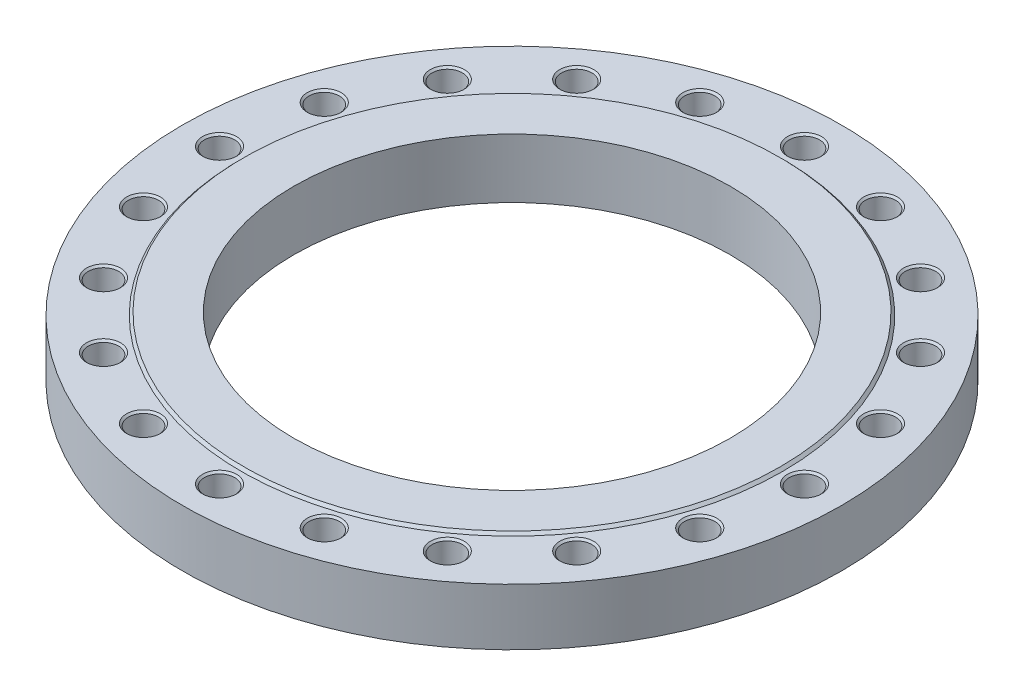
ISO-10303-21;
HEADER;
FILE_DESCRIPTION(('STEP AP214'),'2;1');
FILE_NAME('part.step','',(''),(''),'','','');
FILE_SCHEMA(('AUTOMOTIVE_DESIGN { 1 0 10303 214 1 1 1 1 }'));
ENDSEC;
DATA;
#1=APPLICATION_CONTEXT('core data for automotive mechanical design processes');
#2=APPLICATION_PROTOCOL_DEFINITION('international standard','automotive_design',2000,#1);
#3=PRODUCT_CONTEXT('',#1,'mechanical');
#4=PRODUCT('Part','Part','',(#3));
#5=PRODUCT_RELATED_PRODUCT_CATEGORY('part','',(#4));
#6=PRODUCT_DEFINITION_FORMATION('','',#4);
#7=PRODUCT_DEFINITION_CONTEXT('part definition',#1,'design');
#8=PRODUCT_DEFINITION('design','',#6,#7);
#9=PRODUCT_DEFINITION_SHAPE('','',#8);
#10=(LENGTH_UNIT() NAMED_UNIT(*) SI_UNIT(.MILLI.,.METRE.));
#11=(NAMED_UNIT(*) PLANE_ANGLE_UNIT() SI_UNIT($,.RADIAN.));
#12=(NAMED_UNIT(*) SI_UNIT($,.STERADIAN.) SOLID_ANGLE_UNIT());
#13=UNCERTAINTY_MEASURE_WITH_UNIT(LENGTH_MEASURE(1.E-05),#10,'distance_accuracy_value','');
#14=(GEOMETRIC_REPRESENTATION_CONTEXT(3) GLOBAL_UNCERTAINTY_ASSIGNED_CONTEXT((#13)) GLOBAL_UNIT_ASSIGNED_CONTEXT((#10,
#11,#12)) REPRESENTATION_CONTEXT('',''));
#15=CARTESIAN_POINT('',(0.,0.,0.));
#16=DIRECTION('',(0.,0.,1.));
#17=DIRECTION('',(1.,0.,0.));
#18=AXIS2_PLACEMENT_3D('',#15,#16,#17);
#19=CARTESIAN_POINT('',(0.,32.5,0.));
#20=DIRECTION('',(0.,-1.,0.));
#21=DIRECTION('',(1.,0.,0.));
#22=AXIS2_PLACEMENT_3D('',#19,#20,#21);
#23=CYLINDRICAL_SURFACE('',#22,377.5);
#24=CARTESIAN_POINT('',(0.,0.,0.));
#25=DIRECTION('',(0.,1.,0.));
#26=DIRECTION('',(1.,0.,0.));
#27=AXIS2_PLACEMENT_3D('',#24,#25,#26);
#28=CIRCLE('',#27,377.5);
#29=CARTESIAN_POINT('',(377.5,0.,0.));
#30=VERTEX_POINT('',#29);
#31=EDGE_CURVE('E9',#30,#30,#28,.T.);
#32=ORIENTED_EDGE('',*,*,#31,.T.);
#33=EDGE_LOOP('',(#32));
#34=FACE_BOUND('',#33,.T.);
#35=CARTESIAN_POINT('',(0.,65.,0.));
#36=DIRECTION('',(0.,1.,0.));
#37=DIRECTION('',(1.,0.,0.));
#38=AXIS2_PLACEMENT_3D('',#35,#36,#37);
#39=CIRCLE('',#38,377.5);
#40=CARTESIAN_POINT('',(377.5,65.,0.));
#41=VERTEX_POINT('',#40);
#42=EDGE_CURVE('E625',#41,#41,#39,.T.);
#43=ORIENTED_EDGE('',*,*,#42,.F.);
#44=EDGE_LOOP('',(#43));
#45=FACE_BOUND('',#44,.T.);
#46=ADVANCED_FACE('F15',(#34,#45),#23,.T.);
#47=CARTESIAN_POINT('',(313.75,0.,0.));
#48=DIRECTION('',(0.,-1.,0.));
#49=DIRECTION('',(-1.,0.,0.));
#50=AXIS2_PLACEMENT_3D('',#47,#48,#49);
#51=PLANE('',#50);
#52=CARTESIAN_POINT('',(0.,0.,0.));
#53=DIRECTION('',(0.,1.,0.));
#54=DIRECTION('',(1.,0.,0.));
#55=AXIS2_PLACEMENT_3D('',#52,#53,#54);
#56=CIRCLE('',#55,250.);
#57=CARTESIAN_POINT('',(250.,0.,0.));
#58=VERTEX_POINT('',#57);
#59=EDGE_CURVE('E22',#58,#58,#56,.T.);
#60=ORIENTED_EDGE('',*,*,#59,.T.);
#61=EDGE_LOOP('',(#60));
#62=FACE_BOUND('',#61,.T.);
#63=ORIENTED_EDGE('',*,*,#31,.F.);
#64=EDGE_LOOP('',(#63));
#65=FACE_BOUND('',#64,.T.);
#66=ADVANCED_FACE('F776',(#62,#65),#51,.T.);
#67=CARTESIAN_POINT('',(0.,34.,0.));
#68=DIRECTION('',(0.,-1.,0.));
#69=DIRECTION('',(1.,0.,0.));
#70=AXIS2_PLACEMENT_3D('',#67,#68,#69);
#71=CYLINDRICAL_SURFACE('',#70,250.);
#72=CARTESIAN_POINT('',(0.,68.,0.));
#73=DIRECTION('',(0.,1.,0.));
#74=DIRECTION('',(1.,0.,0.));
#75=AXIS2_PLACEMENT_3D('',#72,#73,#74);
#76=CIRCLE('',#75,250.);
#77=CARTESIAN_POINT('',(250.,68.,0.));
#78=VERTEX_POINT('',#77);
#79=EDGE_CURVE('E535',#78,#78,#76,.T.);
#80=ORIENTED_EDGE('',*,*,#79,.T.);
#81=EDGE_LOOP('',(#80));
#82=FACE_BOUND('',#81,.T.);
#83=ORIENTED_EDGE('',*,*,#59,.F.);
#84=EDGE_LOOP('',(#83));
#85=FACE_BOUND('',#84,.T.);
#86=ADVANCED_FACE('F780',(#82,#85),#71,.F.);
#87=CARTESIAN_POINT('',(278.5,68.,0.));
#88=DIRECTION('',(0.,1.,0.));
#89=DIRECTION('',(1.,0.,0.));
#90=AXIS2_PLACEMENT_3D('',#87,#88,#89);
#91=PLANE('',#90);
#92=CARTESIAN_POINT('',(0.,68.,0.));
#93=DIRECTION('',(0.,1.,0.));
#94=DIRECTION('',(1.,0.,0.));
#95=AXIS2_PLACEMENT_3D('',#92,#93,#94);
#96=CIRCLE('',#95,307.);
#97=CARTESIAN_POINT('',(307.,68.,0.));
#98=VERTEX_POINT('',#97);
#99=EDGE_CURVE('E623',#98,#98,#96,.T.);
#100=ORIENTED_EDGE('',*,*,#99,.T.);
#101=EDGE_LOOP('',(#100));
#102=FACE_BOUND('',#101,.T.);
#103=ORIENTED_EDGE('',*,*,#79,.F.);
#104=EDGE_LOOP('',(#103));
#105=FACE_BOUND('',#104,.T.);
#106=ADVANCED_FACE('F786',(#102,#105),#91,.T.);
#107=CARTESIAN_POINT('',(0.,66.5,0.));
#108=DIRECTION('',(0.,-1.,0.));
#109=DIRECTION('',(1.,0.,0.));
#110=AXIS2_PLACEMENT_3D('',#107,#108,#109);
#111=CONICAL_SURFACE('',#110,308.5,0.785398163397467);
#112=CARTESIAN_POINT('',(0.,65.,0.));
#113=DIRECTION('',(0.,1.,0.));
#114=DIRECTION('',(1.,0.,0.));
#115=AXIS2_PLACEMENT_3D('',#112,#113,#114);
#116=CIRCLE('',#115,310.);
#117=CARTESIAN_POINT('',(310.,65.,0.));
#118=VERTEX_POINT('',#117);
#119=EDGE_CURVE('E474',#118,#118,#116,.T.);
#120=ORIENTED_EDGE('',*,*,#119,.T.);
#121=EDGE_LOOP('',(#120));
#122=FACE_BOUND('',#121,.T.);
#123=ORIENTED_EDGE('',*,*,#99,.F.);
#124=EDGE_LOOP('',(#123));
#125=FACE_BOUND('',#124,.T.);
#126=ADVANCED_FACE('F715',(#122,#125),#111,.T.);
#127=CARTESIAN_POINT('',(343.75,65.,0.));
#128=DIRECTION('',(0.,1.,0.));
#129=DIRECTION('',(1.,0.,0.));
#130=AXIS2_PLACEMENT_3D('',#127,#128,#129);
#131=PLANE('',#130);
#132=ORIENTED_EDGE('',*,*,#42,.T.);
#133=EDGE_LOOP('',(#132));
#134=FACE_BOUND('',#133,.T.);
#135=ORIENTED_EDGE('',*,*,#119,.F.);
#136=EDGE_LOOP('',(#135));
#137=FACE_BOUND('',#136,.T.);
#138=CARTESIAN_POINT('',(335.,65.,0.));
#139=DIRECTION('',(0.,-1.,0.));
#140=DIRECTION('',(1.,0.,0.));
#141=AXIS2_PLACEMENT_3D('',#138,#139,#140);
#142=CIRCLE('',#141,19.5);
#143=CARTESIAN_POINT('',(354.5,65.,0.));
#144=VERTEX_POINT('',#143);
#145=EDGE_CURVE('E603',#144,#144,#142,.T.);
#146=ORIENTED_EDGE('',*,*,#145,.T.);
#147=EDGE_LOOP('',(#146));
#148=FACE_BOUND('',#147,.T.);
#149=CARTESIAN_POINT('',(318.603932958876,65.,-103.520693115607));
#150=DIRECTION('',(0.,-1.,0.));
#151=DIRECTION('',(0.951056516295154,0.,-0.309016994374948));
#152=AXIS2_PLACEMENT_3D('',#149,#150,#151);
#153=CIRCLE('',#152,19.5);
#154=CARTESIAN_POINT('',(337.149535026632,65.,-109.546524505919));
#155=VERTEX_POINT('',#154);
#156=EDGE_CURVE('E565',#155,#155,#153,.T.);
#157=ORIENTED_EDGE('',*,*,#156,.T.);
#158=EDGE_LOOP('',(#157));
#159=FACE_BOUND('',#158,.T.);
#160=CARTESIAN_POINT('',(271.020693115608,65.,-196.908059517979));
#161=DIRECTION('',(0.,-1.,0.));
#162=DIRECTION('',(0.809016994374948,0.,-0.587785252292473));
#163=AXIS2_PLACEMENT_3D('',#160,#161,#162);
#164=CIRCLE('',#163,19.5);
#165=CARTESIAN_POINT('',(286.796524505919,65.,-208.369871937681));
#166=VERTEX_POINT('',#165);
#167=EDGE_CURVE('E590',#166,#166,#164,.T.);
#168=ORIENTED_EDGE('',*,*,#167,.T.);
#169=EDGE_LOOP('',(#168));
#170=FACE_BOUND('',#169,.T.);
#171=CARTESIAN_POINT('',(196.908059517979,65.,-271.020693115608));
#172=DIRECTION('',(0.,-1.,0.));
#173=DIRECTION('',(0.587785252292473,0.,-0.809016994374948));
#174=AXIS2_PLACEMENT_3D('',#171,#172,#173);
#175=CIRCLE('',#174,19.5);
#176=CARTESIAN_POINT('',(208.369871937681,65.,-286.796524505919));
#177=VERTEX_POINT('',#176);
#178=EDGE_CURVE('E621',#177,#177,#175,.T.);
#179=ORIENTED_EDGE('',*,*,#178,.T.);
#180=EDGE_LOOP('',(#179));
#181=FACE_BOUND('',#180,.T.);
#182=CARTESIAN_POINT('',(103.520693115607,65.,-318.603932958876));
#183=DIRECTION('',(0.,-1.,0.));
#184=DIRECTION('',(0.309016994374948,0.,-0.951056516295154));
#185=AXIS2_PLACEMENT_3D('',#182,#183,#184);
#186=CIRCLE('',#185,19.5);
#187=CARTESIAN_POINT('',(109.546524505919,65.,-337.149535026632));
#188=VERTEX_POINT('',#187);
#189=EDGE_CURVE('E698',#188,#188,#186,.T.);
#190=ORIENTED_EDGE('',*,*,#189,.T.);
#191=EDGE_LOOP('',(#190));
#192=FACE_BOUND('',#191,.T.);
#193=CARTESIAN_POINT('',(0.,65.,-335.));
#194=DIRECTION('',(0.,-1.,0.));
#195=DIRECTION('',(0.,0.,-1.));
#196=AXIS2_PLACEMENT_3D('',#193,#194,#195);
#197=CIRCLE('',#196,19.5);
#198=CARTESIAN_POINT('',(0.,65.,-354.5));
#199=VERTEX_POINT('',#198);
#200=EDGE_CURVE('E673',#199,#199,#197,.T.);
#201=ORIENTED_EDGE('',*,*,#200,.T.);
#202=EDGE_LOOP('',(#201));
#203=FACE_BOUND('',#202,.T.);
#204=CARTESIAN_POINT('',(-103.520693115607,65.,-318.603932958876));
#205=DIRECTION('',(0.,-1.,0.));
#206=DIRECTION('',(-0.309016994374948,0.,-0.951056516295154));
#207=AXIS2_PLACEMENT_3D('',#204,#205,#206);
#208=CIRCLE('',#207,19.5);
#209=CARTESIAN_POINT('',(-109.546524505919,65.,-337.149535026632));
#210=VERTEX_POINT('',#209);
#211=EDGE_CURVE('E664',#210,#210,#208,.T.);
#212=ORIENTED_EDGE('',*,*,#211,.T.);
#213=EDGE_LOOP('',(#212));
#214=FACE_BOUND('',#213,.T.);
#215=CARTESIAN_POINT('',(-196.908059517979,65.,-271.020693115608));
#216=DIRECTION('',(0.,-1.,0.));
#217=DIRECTION('',(-0.587785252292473,0.,-0.809016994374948));
#218=AXIS2_PLACEMENT_3D('',#215,#216,#217);
#219=CIRCLE('',#218,19.5);
#220=CARTESIAN_POINT('',(-208.369871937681,65.,-286.796524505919));
#221=VERTEX_POINT('',#220);
#222=EDGE_CURVE('E521',#221,#221,#219,.T.);
#223=ORIENTED_EDGE('',*,*,#222,.T.);
#224=EDGE_LOOP('',(#223));
#225=FACE_BOUND('',#224,.T.);
#226=CARTESIAN_POINT('',(-271.020693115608,65.,-196.908059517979));
#227=DIRECTION('',(0.,-1.,0.));
#228=DIRECTION('',(-0.809016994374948,0.,-0.587785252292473));
#229=AXIS2_PLACEMENT_3D('',#226,#227,#228);
#230=CIRCLE('',#229,19.5);
#231=CARTESIAN_POINT('',(-286.796524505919,65.,-208.369871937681));
#232=VERTEX_POINT('',#231);
#233=EDGE_CURVE('E544',#232,#232,#230,.T.);
#234=ORIENTED_EDGE('',*,*,#233,.T.);
#235=EDGE_LOOP('',(#234));
#236=FACE_BOUND('',#235,.T.);
#237=CARTESIAN_POINT('',(-318.603932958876,65.,-103.520693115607));
#238=DIRECTION('',(0.,-1.,0.));
#239=DIRECTION('',(-0.951056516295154,0.,-0.309016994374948));
#240=AXIS2_PLACEMENT_3D('',#237,#238,#239);
#241=CIRCLE('',#240,19.5);
#242=CARTESIAN_POINT('',(-337.149535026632,65.,-109.546524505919));
#243=VERTEX_POINT('',#242);
#244=EDGE_CURVE('E663',#243,#243,#241,.T.);
#245=ORIENTED_EDGE('',*,*,#244,.T.);
#246=EDGE_LOOP('',(#245));
#247=FACE_BOUND('',#246,.T.);
#248=CARTESIAN_POINT('',(-335.,65.,0.));
#249=DIRECTION('',(0.,-1.,0.));
#250=DIRECTION('',(-1.,0.,0.));
#251=AXIS2_PLACEMENT_3D('',#248,#249,#250);
#252=CIRCLE('',#251,19.5);
#253=CARTESIAN_POINT('',(-354.5,65.,0.));
#254=VERTEX_POINT('',#253);
#255=EDGE_CURVE('E641',#254,#254,#252,.T.);
#256=ORIENTED_EDGE('',*,*,#255,.T.);
#257=EDGE_LOOP('',(#256));
#258=FACE_BOUND('',#257,.T.);
#259=CARTESIAN_POINT('',(-318.603932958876,65.,103.520693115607));
#260=DIRECTION('',(0.,-1.,0.));
#261=DIRECTION('',(-0.951056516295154,0.,0.309016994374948));
#262=AXIS2_PLACEMENT_3D('',#259,#260,#261);
#263=CIRCLE('',#262,19.5);
#264=CARTESIAN_POINT('',(-337.149535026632,65.,109.546524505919));
#265=VERTEX_POINT('',#264);
#266=EDGE_CURVE('E632',#265,#265,#263,.T.);
#267=ORIENTED_EDGE('',*,*,#266,.T.);
#268=EDGE_LOOP('',(#267));
#269=FACE_BOUND('',#268,.T.);
#270=CARTESIAN_POINT('',(-271.020693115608,65.,196.908059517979));
#271=DIRECTION('',(0.,-1.,0.));
#272=DIRECTION('',(-0.809016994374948,0.,0.587785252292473));
#273=AXIS2_PLACEMENT_3D('',#270,#271,#272);
#274=CIRCLE('',#273,19.5);
#275=CARTESIAN_POINT('',(-286.796524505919,65.,208.369871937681));
#276=VERTEX_POINT('',#275);
#277=EDGE_CURVE('E616',#276,#276,#274,.T.);
#278=ORIENTED_EDGE('',*,*,#277,.T.);
#279=EDGE_LOOP('',(#278));
#280=FACE_BOUND('',#279,.T.);
#281=CARTESIAN_POINT('',(-196.908059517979,65.,271.020693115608));
#282=DIRECTION('',(0.,-1.,0.));
#283=DIRECTION('',(-0.587785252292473,0.,0.809016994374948));
#284=AXIS2_PLACEMENT_3D('',#281,#282,#283);
#285=CIRCLE('',#284,19.5);
#286=CARTESIAN_POINT('',(-208.369871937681,65.,286.796524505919));
#287=VERTEX_POINT('',#286);
#288=EDGE_CURVE('E599',#287,#287,#285,.T.);
#289=ORIENTED_EDGE('',*,*,#288,.T.);
#290=EDGE_LOOP('',(#289));
#291=FACE_BOUND('',#290,.T.);
#292=CARTESIAN_POINT('',(-103.520693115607,65.,318.603932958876));
#293=DIRECTION('',(0.,-1.,0.));
#294=DIRECTION('',(-0.309016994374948,0.,0.951056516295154));
#295=AXIS2_PLACEMENT_3D('',#292,#293,#294);
#296=CIRCLE('',#295,19.5);
#297=CARTESIAN_POINT('',(-109.546524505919,65.,337.149535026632));
#298=VERTEX_POINT('',#297);
#299=EDGE_CURVE('E581',#298,#298,#296,.T.);
#300=ORIENTED_EDGE('',*,*,#299,.T.);
#301=EDGE_LOOP('',(#300));
#302=FACE_BOUND('',#301,.T.);
#303=CARTESIAN_POINT('',(0.,65.,335.));
#304=DIRECTION('',(0.,-1.,0.));
#305=DIRECTION('',(0.,0.,1.));
#306=AXIS2_PLACEMENT_3D('',#303,#304,#305);
#307=CIRCLE('',#306,19.5);
#308=CARTESIAN_POINT('',(0.,65.,354.5));
#309=VERTEX_POINT('',#308);
#310=EDGE_CURVE('E559',#309,#309,#307,.T.);
#311=ORIENTED_EDGE('',*,*,#310,.T.);
#312=EDGE_LOOP('',(#311));
#313=FACE_BOUND('',#312,.T.);
#314=CARTESIAN_POINT('',(103.520693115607,65.,318.603932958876));
#315=DIRECTION('',(0.,-1.,0.));
#316=DIRECTION('',(0.309016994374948,0.,0.951056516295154));
#317=AXIS2_PLACEMENT_3D('',#314,#315,#316);
#318=CIRCLE('',#317,19.5);
#319=CARTESIAN_POINT('',(109.546524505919,65.,337.149535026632));
#320=VERTEX_POINT('',#319);
#321=EDGE_CURVE('E533',#320,#320,#318,.T.);
#322=ORIENTED_EDGE('',*,*,#321,.T.);
#323=EDGE_LOOP('',(#322));
#324=FACE_BOUND('',#323,.T.);
#325=CARTESIAN_POINT('',(196.908059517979,65.,271.020693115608));
#326=DIRECTION('',(0.,-1.,0.));
#327=DIRECTION('',(0.587785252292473,0.,0.809016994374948));
#328=AXIS2_PLACEMENT_3D('',#325,#326,#327);
#329=CIRCLE('',#328,19.5);
#330=CARTESIAN_POINT('',(208.369871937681,65.,286.796524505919));
#331=VERTEX_POINT('',#330);
#332=EDGE_CURVE('E485',#331,#331,#329,.T.);
#333=ORIENTED_EDGE('',*,*,#332,.T.);
#334=EDGE_LOOP('',(#333));
#335=FACE_BOUND('',#334,.T.);
#336=CARTESIAN_POINT('',(271.020693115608,65.,196.908059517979));
#337=DIRECTION('',(0.,-1.,0.));
#338=DIRECTION('',(0.809016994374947,0.,0.587785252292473));
#339=AXIS2_PLACEMENT_3D('',#336,#337,#338);
#340=CIRCLE('',#339,19.5);
#341=CARTESIAN_POINT('',(286.796524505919,65.,208.369871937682));
#342=VERTEX_POINT('',#341);
#343=EDGE_CURVE('E498',#342,#342,#340,.T.);
#344=ORIENTED_EDGE('',*,*,#343,.T.);
#345=EDGE_LOOP('',(#344));
#346=FACE_BOUND('',#345,.T.);
#347=CARTESIAN_POINT('',(318.603932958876,65.,103.520693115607));
#348=DIRECTION('',(0.,-1.,0.));
#349=DIRECTION('',(0.951056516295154,0.,0.309016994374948));
#350=AXIS2_PLACEMENT_3D('',#347,#348,#349);
#351=CIRCLE('',#350,19.5);
#352=CARTESIAN_POINT('',(337.149535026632,65.,109.546524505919));
#353=VERTEX_POINT('',#352);
#354=EDGE_CURVE('E466',#353,#353,#351,.T.);
#355=ORIENTED_EDGE('',*,*,#354,.T.);
#356=EDGE_LOOP('',(#355));
#357=FACE_BOUND('',#356,.T.);
#358=ADVANCED_FACE('F718',(#134,#137,#148,#159,#170,#181,#192,#203,#214,#225,#236,#247,#258,
#269,#280,#291,#302,#313,#324,#335,#346,#357),#131,.T.);
#359=CARTESIAN_POINT('',(335.,9.99581654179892,0.));
#360=DIRECTION('',(0.,1.,0.));
#361=DIRECTION('',(1.,0.,0.));
#362=AXIS2_PLACEMENT_3D('',#359,#360,#361);
#363=CONICAL_SURFACE('',#362,8.6675,1.0471975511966);
#364=CARTESIAN_POINT('',(335.,15.,0.));
#365=DIRECTION('',(0.,-1.,0.));
#366=DIRECTION('',(1.,0.,0.));
#367=AXIS2_PLACEMENT_3D('',#364,#365,#366);
#368=CIRCLE('',#367,17.335);
#369=CARTESIAN_POINT('',(352.335,15.,0.));
#370=VERTEX_POINT('',#369);
#371=EDGE_CURVE('E473',#370,#370,#368,.T.);
#372=ORIENTED_EDGE('',*,*,#371,.F.);
#373=EDGE_LOOP('',(#372));
#374=FACE_BOUND('',#373,.T.);
#375=CARTESIAN_POINT('',(335.,4.99163308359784,0.));
#376=VERTEX_POINT('',#375);
#377=VERTEX_LOOP('',#376);
#378=FACE_BOUND('',#377,.T.);
#379=ADVANCED_FACE('F721',(#374,#378),#363,.F.);
#380=CARTESIAN_POINT('',(335.,19.9175,0.));
#381=DIRECTION('',(0.,1.,0.));
#382=DIRECTION('',(1.,0.,0.));
#383=AXIS2_PLACEMENT_3D('',#380,#381,#382);
#384=CYLINDRICAL_SURFACE('',#383,17.335);
#385=CARTESIAN_POINT('',(335.,24.835,0.));
#386=DIRECTION('',(0.,-1.,0.));
#387=DIRECTION('',(1.,0.,0.));
#388=AXIS2_PLACEMENT_3D('',#385,#386,#387);
#389=CIRCLE('',#388,17.335);
#390=CARTESIAN_POINT('',(352.335,24.835,0.));
#391=VERTEX_POINT('',#390);
#392=EDGE_CURVE('E475',#391,#391,#389,.T.);
#393=ORIENTED_EDGE('',*,*,#392,.F.);
#394=EDGE_LOOP('',(#393));
#395=FACE_BOUND('',#394,.T.);
#396=ORIENTED_EDGE('',*,*,#371,.T.);
#397=EDGE_LOOP('',(#396));
#398=FACE_BOUND('',#397,.T.);
#399=ADVANCED_FACE('F793',(#395,#398),#384,.F.);
#400=CARTESIAN_POINT('',(335.,25.9175,0.));
#401=DIRECTION('',(0.,1.,0.));
#402=DIRECTION('',(1.,0.,0.));
#403=AXIS2_PLACEMENT_3D('',#400,#401,#402);
#404=CONICAL_SURFACE('',#403,18.4175,0.785398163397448);
#405=CARTESIAN_POINT('',(335.,27.,0.));
#406=DIRECTION('',(0.,-1.,0.));
#407=DIRECTION('',(1.,0.,0.));
#408=AXIS2_PLACEMENT_3D('',#405,#406,#407);
#409=CIRCLE('',#408,19.5);
#410=CARTESIAN_POINT('',(354.5,27.,0.));
#411=VERTEX_POINT('',#410);
#412=EDGE_CURVE('E602',#411,#411,#409,.T.);
#413=ORIENTED_EDGE('',*,*,#412,.F.);
#414=EDGE_LOOP('',(#413));
#415=FACE_BOUND('',#414,.T.);
#416=ORIENTED_EDGE('',*,*,#392,.T.);
#417=EDGE_LOOP('',(#416));
#418=FACE_BOUND('',#417,.T.);
#419=ADVANCED_FACE('F795',(#415,#418),#404,.F.);
#420=CARTESIAN_POINT('',(353.4175,27.,0.));
#421=DIRECTION('',(0.,1.,0.));
#422=DIRECTION('',(-1.,0.,0.));
#423=AXIS2_PLACEMENT_3D('',#420,#421,#422);
#424=PLANE('',#423);
#425=CARTESIAN_POINT('',(335.,27.,0.));
#426=DIRECTION('',(0.,-1.,0.));
#427=DIRECTION('',(1.,0.,0.));
#428=AXIS2_PLACEMENT_3D('',#425,#426,#427);
#429=CIRCLE('',#428,17.335);
#430=CARTESIAN_POINT('',(352.335,27.,0.));
#431=VERTEX_POINT('',#430);
#432=EDGE_CURVE('E600',#431,#431,#429,.T.);
#433=ORIENTED_EDGE('',*,*,#432,.F.);
#434=EDGE_LOOP('',(#433));
#435=FACE_BOUND('',#434,.T.);
#436=ORIENTED_EDGE('',*,*,#412,.T.);
#437=EDGE_LOOP('',(#436));
#438=FACE_BOUND('',#437,.T.);
#439=ADVANCED_FACE('F798',(#435,#438),#424,.F.);
#440=CARTESIAN_POINT('',(335.,44.9175,0.));
#441=DIRECTION('',(0.,1.,0.));
#442=DIRECTION('',(1.,0.,0.));
#443=AXIS2_PLACEMENT_3D('',#440,#441,#442);
#444=CYLINDRICAL_SURFACE('',#443,17.335);
#445=CARTESIAN_POINT('',(335.,62.835,0.));
#446=DIRECTION('',(0.,-1.,0.));
#447=DIRECTION('',(1.,0.,0.));
#448=AXIS2_PLACEMENT_3D('',#445,#446,#447);
#449=CIRCLE('',#448,17.335);
#450=CARTESIAN_POINT('',(352.335,62.835,0.));
#451=VERTEX_POINT('',#450);
#452=EDGE_CURVE('E652',#451,#451,#449,.T.);
#453=ORIENTED_EDGE('',*,*,#452,.F.);
#454=EDGE_LOOP('',(#453));
#455=FACE_BOUND('',#454,.T.);
#456=ORIENTED_EDGE('',*,*,#432,.T.);
#457=EDGE_LOOP('',(#456));
#458=FACE_BOUND('',#457,.T.);
#459=ADVANCED_FACE('F1198',(#455,#458),#444,.F.);
#460=CARTESIAN_POINT('',(335.,63.9175,0.));
#461=DIRECTION('',(0.,1.,0.));
#462=DIRECTION('',(1.,0.,0.));
#463=AXIS2_PLACEMENT_3D('',#460,#461,#462);
#464=CONICAL_SURFACE('',#463,18.4175,0.785398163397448);
#465=ORIENTED_EDGE('',*,*,#145,.F.);
#466=EDGE_LOOP('',(#465));
#467=FACE_BOUND('',#466,.T.);
#468=ORIENTED_EDGE('',*,*,#452,.T.);
#469=EDGE_LOOP('',(#468));
#470=FACE_BOUND('',#469,.T.);
#471=ADVANCED_FACE('F1181',(#467,#470),#464,.F.);
#472=CARTESIAN_POINT('',(318.603932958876,9.99581654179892,-103.520693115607));
#473=DIRECTION('',(0.,1.,0.));
#474=DIRECTION('',(0.951056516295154,0.,-0.309016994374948));
#475=AXIS2_PLACEMENT_3D('',#472,#473,#474);
#476=CONICAL_SURFACE('',#475,8.6675,1.0471975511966);
#477=CARTESIAN_POINT('',(318.603932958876,15.,-103.520693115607));
#478=DIRECTION('',(0.,-1.,0.));
#479=DIRECTION('',(0.951056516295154,0.,-0.309016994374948));
#480=AXIS2_PLACEMENT_3D('',#477,#478,#479);
#481=CIRCLE('',#480,17.335);
#482=CARTESIAN_POINT('',(335.090497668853,15.,-108.877502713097));
#483=VERTEX_POINT('',#482);
#484=EDGE_CURVE('E517',#483,#483,#481,.T.);
#485=ORIENTED_EDGE('',*,*,#484,.F.);
#486=EDGE_LOOP('',(#485));
#487=FACE_BOUND('',#486,.T.);
#488=CARTESIAN_POINT('',(318.603932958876,4.99163308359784,-103.520693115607));
#489=VERTEX_POINT('',#488);
#490=VERTEX_LOOP('',#489);
#491=FACE_BOUND('',#490,.T.);
#492=ADVANCED_FACE('F1002',(#487,#491),#476,.F.);
#493=CARTESIAN_POINT('',(318.603932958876,19.9175,-103.520693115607));
#494=DIRECTION('',(0.,1.,0.));
#495=DIRECTION('',(0.951056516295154,0.,-0.309016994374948));
#496=AXIS2_PLACEMENT_3D('',#493,#494,#495);
#497=CYLINDRICAL_SURFACE('',#496,17.335);
#498=CARTESIAN_POINT('',(318.603932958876,24.835,-103.520693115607));
#499=DIRECTION('',(0.,-1.,0.));
#500=DIRECTION('',(0.951056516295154,0.,-0.309016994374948));
#501=AXIS2_PLACEMENT_3D('',#498,#499,#500);
#502=CIRCLE('',#501,17.335);
#503=CARTESIAN_POINT('',(335.090497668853,24.835,-108.877502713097));
#504=VERTEX_POINT('',#503);
#505=EDGE_CURVE('E479',#504,#504,#502,.T.);
#506=ORIENTED_EDGE('',*,*,#505,.F.);
#507=EDGE_LOOP('',(#506));
#508=FACE_BOUND('',#507,.T.);
#509=ORIENTED_EDGE('',*,*,#484,.T.);
#510=EDGE_LOOP('',(#509));
#511=FACE_BOUND('',#510,.T.);
#512=ADVANCED_FACE('F998',(#508,#511),#497,.F.);
#513=CARTESIAN_POINT('',(318.603932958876,25.9175,-103.520693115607));
#514=DIRECTION('',(0.,1.,0.));
#515=DIRECTION('',(0.951056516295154,0.,-0.309016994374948));
#516=AXIS2_PLACEMENT_3D('',#513,#514,#515);
#517=CONICAL_SURFACE('',#516,18.4175,0.785398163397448);
#518=CARTESIAN_POINT('',(318.603932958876,27.,-103.520693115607));
#519=DIRECTION('',(0.,-1.,0.));
#520=DIRECTION('',(0.951056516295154,0.,-0.309016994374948));
#521=AXIS2_PLACEMENT_3D('',#518,#519,#520);
#522=CIRCLE('',#521,19.5);
#523=CARTESIAN_POINT('',(337.149535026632,27.,-109.546524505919));
#524=VERTEX_POINT('',#523);
#525=EDGE_CURVE('E477',#524,#524,#522,.T.);
#526=ORIENTED_EDGE('',*,*,#525,.F.);
#527=EDGE_LOOP('',(#526));
#528=FACE_BOUND('',#527,.T.);
#529=ORIENTED_EDGE('',*,*,#505,.T.);
#530=EDGE_LOOP('',(#529));
#531=FACE_BOUND('',#530,.T.);
#532=ADVANCED_FACE('F1001',(#528,#531),#517,.F.);
#533=CARTESIAN_POINT('',(336.120016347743,27.,-109.212013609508));
#534=DIRECTION('',(0.,1.,0.));
#535=DIRECTION('',(-0.951056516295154,0.,0.309016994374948));
#536=AXIS2_PLACEMENT_3D('',#533,#534,#535);
#537=PLANE('',#536);
#538=CARTESIAN_POINT('',(318.603932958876,27.,-103.520693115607));
#539=DIRECTION('',(0.,-1.,0.));
#540=DIRECTION('',(0.951056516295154,0.,-0.309016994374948));
#541=AXIS2_PLACEMENT_3D('',#538,#539,#540);
#542=CIRCLE('',#541,17.335);
#543=CARTESIAN_POINT('',(335.090497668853,27.,-108.877502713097));
#544=VERTEX_POINT('',#543);
#545=EDGE_CURVE('E480',#544,#544,#542,.T.);
#546=ORIENTED_EDGE('',*,*,#545,.F.);
#547=EDGE_LOOP('',(#546));
#548=FACE_BOUND('',#547,.T.);
#549=ORIENTED_EDGE('',*,*,#525,.T.);
#550=EDGE_LOOP('',(#549));
#551=FACE_BOUND('',#550,.T.);
#552=ADVANCED_FACE('F954',(#548,#551),#537,.F.);
#553=CARTESIAN_POINT('',(318.603932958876,44.9175,-103.520693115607));
#554=DIRECTION('',(0.,1.,0.));
#555=DIRECTION('',(0.951056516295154,0.,-0.309016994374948));
#556=AXIS2_PLACEMENT_3D('',#553,#554,#555);
#557=CYLINDRICAL_SURFACE('',#556,17.335);
#558=CARTESIAN_POINT('',(318.603932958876,62.835,-103.520693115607));
#559=DIRECTION('',(0.,-1.,0.));
#560=DIRECTION('',(0.951056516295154,0.,-0.309016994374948));
#561=AXIS2_PLACEMENT_3D('',#558,#559,#560);
#562=CIRCLE('',#561,17.335);
#563=CARTESIAN_POINT('',(335.090497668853,62.835,-108.877502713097));
#564=VERTEX_POINT('',#563);
#565=EDGE_CURVE('E626',#564,#564,#562,.T.);
#566=ORIENTED_EDGE('',*,*,#565,.F.);
#567=EDGE_LOOP('',(#566));
#568=FACE_BOUND('',#567,.T.);
#569=ORIENTED_EDGE('',*,*,#545,.T.);
#570=EDGE_LOOP('',(#569));
#571=FACE_BOUND('',#570,.T.);
#572=ADVANCED_FACE('F804',(#568,#571),#557,.F.);
#573=CARTESIAN_POINT('',(318.603932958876,63.9175,-103.520693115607));
#574=DIRECTION('',(0.,1.,0.));
#575=DIRECTION('',(0.951056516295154,0.,-0.309016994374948));
#576=AXIS2_PLACEMENT_3D('',#573,#574,#575);
#577=CONICAL_SURFACE('',#576,18.4175,0.785398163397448);
#578=ORIENTED_EDGE('',*,*,#156,.F.);
#579=EDGE_LOOP('',(#578));
#580=FACE_BOUND('',#579,.T.);
#581=ORIENTED_EDGE('',*,*,#565,.T.);
#582=EDGE_LOOP('',(#581));
#583=FACE_BOUND('',#582,.T.);
#584=ADVANCED_FACE('F800',(#580,#583),#577,.F.);
#585=CARTESIAN_POINT('',(271.020693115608,9.99581654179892,-196.908059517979));
#586=DIRECTION('',(0.,1.,0.));
#587=DIRECTION('',(0.809016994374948,0.,-0.587785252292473));
#588=AXIS2_PLACEMENT_3D('',#585,#586,#587);
#589=CONICAL_SURFACE('',#588,8.6675,1.0471975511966);
#590=CARTESIAN_POINT('',(271.020693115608,15.,-196.908059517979));
#591=DIRECTION('',(0.,-1.,0.));
#592=DIRECTION('',(0.809016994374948,0.,-0.587785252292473));
#593=AXIS2_PLACEMENT_3D('',#590,#591,#592);
#594=CIRCLE('',#593,17.335);
#595=CARTESIAN_POINT('',(285.045002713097,15.,-207.097316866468));
#596=VERTEX_POINT('',#595);
#597=EDGE_CURVE('E628',#596,#596,#594,.T.);
#598=ORIENTED_EDGE('',*,*,#597,.F.);
#599=EDGE_LOOP('',(#598));
#600=FACE_BOUND('',#599,.T.);
#601=CARTESIAN_POINT('',(271.020693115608,4.99163308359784,-196.908059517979));
#602=VERTEX_POINT('',#601);
#603=VERTEX_LOOP('',#602);
#604=FACE_BOUND('',#603,.T.);
#605=ADVANCED_FACE('F803',(#600,#604),#589,.F.);
#606=CARTESIAN_POINT('',(271.020693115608,19.9175,-196.908059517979));
#607=DIRECTION('',(0.,1.,0.));
#608=DIRECTION('',(0.809016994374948,0.,-0.587785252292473));
#609=AXIS2_PLACEMENT_3D('',#606,#607,#608);
#610=CYLINDRICAL_SURFACE('',#609,17.335);
#611=CARTESIAN_POINT('',(271.020693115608,24.835,-196.908059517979));
#612=DIRECTION('',(0.,-1.,0.));
#613=DIRECTION('',(0.809016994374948,0.,-0.587785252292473));
#614=AXIS2_PLACEMENT_3D('',#611,#612,#613);
#615=CIRCLE('',#614,17.335);
#616=CARTESIAN_POINT('',(285.045002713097,24.835,-207.097316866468));
#617=VERTEX_POINT('',#616);
#618=EDGE_CURVE('E710',#617,#617,#615,.T.);
#619=ORIENTED_EDGE('',*,*,#618,.F.);
#620=EDGE_LOOP('',(#619));
#621=FACE_BOUND('',#620,.T.);
#622=ORIENTED_EDGE('',*,*,#597,.T.);
#623=EDGE_LOOP('',(#622));
#624=FACE_BOUND('',#623,.T.);
#625=ADVANCED_FACE('F811',(#621,#624),#610,.F.);
#626=CARTESIAN_POINT('',(271.020693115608,25.9175,-196.908059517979));
#627=DIRECTION('',(0.,1.,0.));
#628=DIRECTION('',(0.809016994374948,0.,-0.587785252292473));
#629=AXIS2_PLACEMENT_3D('',#626,#627,#628);
#630=CONICAL_SURFACE('',#629,18.4175,0.785398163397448);
#631=CARTESIAN_POINT('',(271.020693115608,27.,-196.908059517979));
#632=DIRECTION('',(0.,-1.,0.));
#633=DIRECTION('',(0.809016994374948,0.,-0.587785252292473));
#634=AXIS2_PLACEMENT_3D('',#631,#632,#633);
#635=CIRCLE('',#634,19.5);
#636=CARTESIAN_POINT('',(286.796524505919,27.,-208.369871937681));
#637=VERTEX_POINT('',#636);
#638=EDGE_CURVE('E614',#637,#637,#635,.T.);
#639=ORIENTED_EDGE('',*,*,#638,.F.);
#640=EDGE_LOOP('',(#639));
#641=FACE_BOUND('',#640,.T.);
#642=ORIENTED_EDGE('',*,*,#618,.T.);
#643=EDGE_LOOP('',(#642));
#644=FACE_BOUND('',#643,.T.);
#645=ADVANCED_FACE('F815',(#641,#644),#630,.F.);
#646=CARTESIAN_POINT('',(285.920763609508,27.,-207.733594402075));
#647=DIRECTION('',(0.,1.,0.));
#648=DIRECTION('',(-0.809016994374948,0.,0.587785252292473));
#649=AXIS2_PLACEMENT_3D('',#646,#647,#648);
#650=PLANE('',#649);
#651=CARTESIAN_POINT('',(271.020693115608,27.,-196.908059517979));
#652=DIRECTION('',(0.,-1.,0.));
#653=DIRECTION('',(0.809016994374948,0.,-0.587785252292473));
#654=AXIS2_PLACEMENT_3D('',#651,#652,#653);
#655=CIRCLE('',#654,17.335);
#656=CARTESIAN_POINT('',(285.045002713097,27.,-207.097316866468));
#657=VERTEX_POINT('',#656);
#658=EDGE_CURVE('E612',#657,#657,#655,.T.);
#659=ORIENTED_EDGE('',*,*,#658,.F.);
#660=EDGE_LOOP('',(#659));
#661=FACE_BOUND('',#660,.T.);
#662=ORIENTED_EDGE('',*,*,#638,.T.);
#663=EDGE_LOOP('',(#662));
#664=FACE_BOUND('',#663,.T.);
#665=ADVANCED_FACE('F819',(#661,#664),#650,.F.);
#666=CARTESIAN_POINT('',(271.020693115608,44.9175,-196.908059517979));
#667=DIRECTION('',(0.,1.,0.));
#668=DIRECTION('',(0.809016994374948,0.,-0.587785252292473));
#669=AXIS2_PLACEMENT_3D('',#666,#667,#668);
#670=CYLINDRICAL_SURFACE('',#669,17.335);
#671=CARTESIAN_POINT('',(271.020693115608,62.835,-196.908059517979));
#672=DIRECTION('',(0.,-1.,0.));
#673=DIRECTION('',(0.809016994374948,0.,-0.587785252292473));
#674=AXIS2_PLACEMENT_3D('',#671,#672,#673);
#675=CIRCLE('',#674,17.335);
#676=CARTESIAN_POINT('',(285.045002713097,62.835,-207.097316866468));
#677=VERTEX_POINT('',#676);
#678=EDGE_CURVE('E588',#677,#677,#675,.T.);
#679=ORIENTED_EDGE('',*,*,#678,.F.);
#680=EDGE_LOOP('',(#679));
#681=FACE_BOUND('',#680,.T.);
#682=ORIENTED_EDGE('',*,*,#658,.T.);
#683=EDGE_LOOP('',(#682));
#684=FACE_BOUND('',#683,.T.);
#685=ADVANCED_FACE('F823',(#681,#684),#670,.F.);
#686=CARTESIAN_POINT('',(271.020693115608,63.9175,-196.908059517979));
#687=DIRECTION('',(0.,1.,0.));
#688=DIRECTION('',(0.809016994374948,0.,-0.587785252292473));
#689=AXIS2_PLACEMENT_3D('',#686,#687,#688);
#690=CONICAL_SURFACE('',#689,18.4175,0.785398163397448);
#691=ORIENTED_EDGE('',*,*,#167,.F.);
#692=EDGE_LOOP('',(#691));
#693=FACE_BOUND('',#692,.T.);
#694=ORIENTED_EDGE('',*,*,#678,.T.);
#695=EDGE_LOOP('',(#694));
#696=FACE_BOUND('',#695,.T.);
#697=ADVANCED_FACE('F829',(#693,#696),#690,.F.);
#698=CARTESIAN_POINT('',(196.908059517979,9.99581654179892,-271.020693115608));
#699=DIRECTION('',(0.,1.,0.));
#700=DIRECTION('',(0.587785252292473,0.,-0.809016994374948));
#701=AXIS2_PLACEMENT_3D('',#698,#699,#700);
#702=CONICAL_SURFACE('',#701,8.6675,1.0471975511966);
#703=CARTESIAN_POINT('',(196.908059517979,15.,-271.020693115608));
#704=DIRECTION('',(0.,-1.,0.));
#705=DIRECTION('',(0.587785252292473,0.,-0.809016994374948));
#706=AXIS2_PLACEMENT_3D('',#703,#704,#705);
#707=CIRCLE('',#706,17.335);
#708=CARTESIAN_POINT('',(207.097316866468,15.,-285.045002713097));
#709=VERTEX_POINT('',#708);
#710=EDGE_CURVE('E591',#709,#709,#707,.T.);
#711=ORIENTED_EDGE('',*,*,#710,.F.);
#712=EDGE_LOOP('',(#711));
#713=FACE_BOUND('',#712,.T.);
#714=CARTESIAN_POINT('',(196.908059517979,4.99163308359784,-271.020693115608));
#715=VERTEX_POINT('',#714);
#716=VERTEX_LOOP('',#715);
#717=FACE_BOUND('',#716,.T.);
#718=ADVANCED_FACE('F825',(#713,#717),#702,.F.);
#719=CARTESIAN_POINT('',(196.908059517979,19.9175,-271.020693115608));
#720=DIRECTION('',(0.,1.,0.));
#721=DIRECTION('',(0.587785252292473,0.,-0.809016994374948));
#722=AXIS2_PLACEMENT_3D('',#719,#720,#721);
#723=CYLINDRICAL_SURFACE('',#722,17.335);
#724=CARTESIAN_POINT('',(196.908059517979,24.835,-271.020693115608));
#725=DIRECTION('',(0.,-1.,0.));
#726=DIRECTION('',(0.587785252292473,0.,-0.809016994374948));
#727=AXIS2_PLACEMENT_3D('',#724,#725,#726);
#728=CIRCLE('',#727,17.335);
#729=CARTESIAN_POINT('',(207.097316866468,24.835,-285.045002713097));
#730=VERTEX_POINT('',#729);
#731=EDGE_CURVE('E704',#730,#730,#728,.T.);
#732=ORIENTED_EDGE('',*,*,#731,.F.);
#733=EDGE_LOOP('',(#732));
#734=FACE_BOUND('',#733,.T.);
#735=ORIENTED_EDGE('',*,*,#710,.T.);
#736=EDGE_LOOP('',(#735));
#737=FACE_BOUND('',#736,.T.);
#738=ADVANCED_FACE('F828',(#734,#737),#723,.F.);
#739=CARTESIAN_POINT('',(196.908059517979,25.9175,-271.020693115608));
#740=DIRECTION('',(0.,1.,0.));
#741=DIRECTION('',(0.587785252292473,0.,-0.809016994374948));
#742=AXIS2_PLACEMENT_3D('',#739,#740,#741);
#743=CONICAL_SURFACE('',#742,18.4175,0.785398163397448);
#744=CARTESIAN_POINT('',(196.908059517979,27.,-271.020693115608));
#745=DIRECTION('',(0.,-1.,0.));
#746=DIRECTION('',(0.587785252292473,0.,-0.809016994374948));
#747=AXIS2_PLACEMENT_3D('',#744,#745,#746);
#748=CIRCLE('',#747,19.5);
#749=CARTESIAN_POINT('',(208.369871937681,27.,-286.796524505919));
#750=VERTEX_POINT('',#749);
#751=EDGE_CURVE('E702',#750,#750,#748,.T.);
#752=ORIENTED_EDGE('',*,*,#751,.F.);
#753=EDGE_LOOP('',(#752));
#754=FACE_BOUND('',#753,.T.);
#755=ORIENTED_EDGE('',*,*,#731,.T.);
#756=EDGE_LOOP('',(#755));
#757=FACE_BOUND('',#756,.T.);
#758=ADVANCED_FACE('F833',(#754,#757),#743,.F.);
#759=CARTESIAN_POINT('',(207.733594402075,27.,-285.920763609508));
#760=DIRECTION('',(0.,1.,0.));
#761=DIRECTION('',(-0.587785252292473,0.,0.809016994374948));
#762=AXIS2_PLACEMENT_3D('',#759,#760,#761);
#763=PLANE('',#762);
#764=CARTESIAN_POINT('',(196.908059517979,27.,-271.020693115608));
#765=DIRECTION('',(0.,-1.,0.));
#766=DIRECTION('',(0.587785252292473,0.,-0.809016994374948));
#767=AXIS2_PLACEMENT_3D('',#764,#765,#766);
#768=CIRCLE('',#767,17.335);
#769=CARTESIAN_POINT('',(207.097316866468,27.,-285.045002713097));
#770=VERTEX_POINT('',#769);
#771=EDGE_CURVE('E661',#770,#770,#768,.T.);
#772=ORIENTED_EDGE('',*,*,#771,.F.);
#773=EDGE_LOOP('',(#772));
#774=FACE_BOUND('',#773,.T.);
#775=ORIENTED_EDGE('',*,*,#751,.T.);
#776=EDGE_LOOP('',(#775));
#777=FACE_BOUND('',#776,.T.);
#778=ADVANCED_FACE('F837',(#774,#777),#763,.F.);
#779=CARTESIAN_POINT('',(196.908059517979,44.9175,-271.020693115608));
#780=DIRECTION('',(0.,1.,0.));
#781=DIRECTION('',(0.587785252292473,0.,-0.809016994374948));
#782=AXIS2_PLACEMENT_3D('',#779,#780,#781);
#783=CYLINDRICAL_SURFACE('',#782,17.335);
#784=CARTESIAN_POINT('',(196.908059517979,62.835,-271.020693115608));
#785=DIRECTION('',(0.,-1.,0.));
#786=DIRECTION('',(0.587785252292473,0.,-0.809016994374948));
#787=AXIS2_PLACEMENT_3D('',#784,#785,#786);
#788=CIRCLE('',#787,17.335);
#789=CARTESIAN_POINT('',(207.097316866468,62.835,-285.045002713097));
#790=VERTEX_POINT('',#789);
#791=EDGE_CURVE('E527',#790,#790,#788,.T.);
#792=ORIENTED_EDGE('',*,*,#791,.F.);
#793=EDGE_LOOP('',(#792));
#794=FACE_BOUND('',#793,.T.);
#795=ORIENTED_EDGE('',*,*,#771,.T.);
#796=EDGE_LOOP('',(#795));
#797=FACE_BOUND('',#796,.T.);
#798=ADVANCED_FACE('F841',(#794,#797),#783,.F.);
#799=CARTESIAN_POINT('',(196.908059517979,63.9175,-271.020693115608));
#800=DIRECTION('',(0.,1.,0.));
#801=DIRECTION('',(0.587785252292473,0.,-0.809016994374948));
#802=AXIS2_PLACEMENT_3D('',#799,#800,#801);
#803=CONICAL_SURFACE('',#802,18.4175,0.785398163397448);
#804=ORIENTED_EDGE('',*,*,#178,.F.);
#805=EDGE_LOOP('',(#804));
#806=FACE_BOUND('',#805,.T.);
#807=ORIENTED_EDGE('',*,*,#791,.T.);
#808=EDGE_LOOP('',(#807));
#809=FACE_BOUND('',#808,.T.);
#810=ADVANCED_FACE('F845',(#806,#809),#803,.F.);
#811=CARTESIAN_POINT('',(103.520693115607,9.99581654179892,-318.603932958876));
#812=DIRECTION('',(0.,1.,0.));
#813=DIRECTION('',(0.309016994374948,0.,-0.951056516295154));
#814=AXIS2_PLACEMENT_3D('',#811,#812,#813);
#815=CONICAL_SURFACE('',#814,8.6675,1.0471975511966);
#816=CARTESIAN_POINT('',(103.520693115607,15.,-318.603932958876));
#817=DIRECTION('',(0.,-1.,0.));
#818=DIRECTION('',(0.309016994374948,0.,-0.951056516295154));
#819=AXIS2_PLACEMENT_3D('',#816,#817,#818);
#820=CIRCLE('',#819,17.335);
#821=CARTESIAN_POINT('',(108.877502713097,15.,-335.090497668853));
#822=VERTEX_POINT('',#821);
#823=EDGE_CURVE('E509',#822,#822,#820,.T.);
#824=ORIENTED_EDGE('',*,*,#823,.F.);
#825=EDGE_LOOP('',(#824));
#826=FACE_BOUND('',#825,.T.);
#827=CARTESIAN_POINT('',(103.520693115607,4.99163308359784,-318.603932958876));
#828=VERTEX_POINT('',#827);
#829=VERTEX_LOOP('',#828);
#830=FACE_BOUND('',#829,.T.);
#831=ADVANCED_FACE('F849',(#826,#830),#815,.F.);
#832=CARTESIAN_POINT('',(103.520693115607,19.9175,-318.603932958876));
#833=DIRECTION('',(0.,1.,0.));
#834=DIRECTION('',(0.309016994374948,0.,-0.951056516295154));
#835=AXIS2_PLACEMENT_3D('',#832,#833,#834);
#836=CYLINDRICAL_SURFACE('',#835,17.335);
#837=CARTESIAN_POINT('',(103.520693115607,24.835,-318.603932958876));
#838=DIRECTION('',(0.,-1.,0.));
#839=DIRECTION('',(0.309016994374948,0.,-0.951056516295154));
#840=AXIS2_PLACEMENT_3D('',#837,#838,#839);
#841=CIRCLE('',#840,17.335);
#842=CARTESIAN_POINT('',(108.877502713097,24.835,-335.090497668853));
#843=VERTEX_POINT('',#842);
#844=EDGE_CURVE('E507',#843,#843,#841,.T.);
#845=ORIENTED_EDGE('',*,*,#844,.F.);
#846=EDGE_LOOP('',(#845));
#847=FACE_BOUND('',#846,.T.);
#848=ORIENTED_EDGE('',*,*,#823,.T.);
#849=EDGE_LOOP('',(#848));
#850=FACE_BOUND('',#849,.T.);
#851=ADVANCED_FACE('F853',(#847,#850),#836,.F.);
#852=CARTESIAN_POINT('',(103.520693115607,25.9175,-318.603932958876));
#853=DIRECTION('',(0.,1.,0.));
#854=DIRECTION('',(0.309016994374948,0.,-0.951056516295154));
#855=AXIS2_PLACEMENT_3D('',#852,#853,#854);
#856=CONICAL_SURFACE('',#855,18.4175,0.785398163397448);
#857=CARTESIAN_POINT('',(103.520693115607,27.,-318.603932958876));
#858=DIRECTION('',(0.,-1.,0.));
#859=DIRECTION('',(0.309016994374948,0.,-0.951056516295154));
#860=AXIS2_PLACEMENT_3D('',#857,#858,#859);
#861=CIRCLE('',#860,19.5);
#862=CARTESIAN_POINT('',(109.546524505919,27.,-337.149535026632));
#863=VERTEX_POINT('',#862);
#864=EDGE_CURVE('E510',#863,#863,#861,.T.);
#865=ORIENTED_EDGE('',*,*,#864,.F.);
#866=EDGE_LOOP('',(#865));
#867=FACE_BOUND('',#866,.T.);
#868=ORIENTED_EDGE('',*,*,#844,.T.);
#869=EDGE_LOOP('',(#868));
#870=FACE_BOUND('',#869,.T.);
#871=ADVANCED_FACE('F857',(#867,#870),#856,.F.);
#872=CARTESIAN_POINT('',(109.212013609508,27.,-336.120016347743));
#873=DIRECTION('',(0.,1.,0.));
#874=DIRECTION('',(-0.309016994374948,0.,0.951056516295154));
#875=AXIS2_PLACEMENT_3D('',#872,#873,#874);
#876=PLANE('',#875);
#877=CARTESIAN_POINT('',(103.520693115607,27.,-318.603932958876));
#878=DIRECTION('',(0.,-1.,0.));
#879=DIRECTION('',(0.309016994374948,0.,-0.951056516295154));
#880=AXIS2_PLACEMENT_3D('',#877,#878,#879);
#881=CIRCLE('',#880,17.335);
#882=CARTESIAN_POINT('',(108.877502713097,27.,-335.090497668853));
#883=VERTEX_POINT('',#882);
#884=EDGE_CURVE('E643',#883,#883,#881,.T.);
#885=ORIENTED_EDGE('',*,*,#884,.F.);
#886=EDGE_LOOP('',(#885));
#887=FACE_BOUND('',#886,.T.);
#888=ORIENTED_EDGE('',*,*,#864,.T.);
#889=EDGE_LOOP('',(#888));
#890=FACE_BOUND('',#889,.T.);
#891=ADVANCED_FACE('F859',(#887,#890),#876,.F.);
#892=CARTESIAN_POINT('',(103.520693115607,44.9175,-318.603932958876));
#893=DIRECTION('',(0.,1.,0.));
#894=DIRECTION('',(0.309016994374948,0.,-0.951056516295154));
#895=AXIS2_PLACEMENT_3D('',#892,#893,#894);
#896=CYLINDRICAL_SURFACE('',#895,17.335);
#897=CARTESIAN_POINT('',(103.520693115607,62.835,-318.603932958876));
#898=DIRECTION('',(0.,-1.,0.));
#899=DIRECTION('',(0.309016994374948,0.,-0.951056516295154));
#900=AXIS2_PLACEMENT_3D('',#897,#898,#899);
#901=CIRCLE('',#900,17.335);
#902=CARTESIAN_POINT('',(108.877502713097,62.835,-335.090497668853));
#903=VERTEX_POINT('',#902);
#904=EDGE_CURVE('E472',#903,#903,#901,.T.);
#905=ORIENTED_EDGE('',*,*,#904,.F.);
#906=EDGE_LOOP('',(#905));
#907=FACE_BOUND('',#906,.T.);
#908=ORIENTED_EDGE('',*,*,#884,.T.);
#909=EDGE_LOOP('',(#908));
#910=FACE_BOUND('',#909,.T.);
#911=ADVANCED_FACE('F862',(#907,#910),#896,.F.);
#912=CARTESIAN_POINT('',(103.520693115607,63.9175,-318.603932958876));
#913=DIRECTION('',(0.,1.,0.));
#914=DIRECTION('',(0.309016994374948,0.,-0.951056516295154));
#915=AXIS2_PLACEMENT_3D('',#912,#913,#914);
#916=CONICAL_SURFACE('',#915,18.4175,0.785398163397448);
#917=ORIENTED_EDGE('',*,*,#189,.F.);
#918=EDGE_LOOP('',(#917));
#919=FACE_BOUND('',#918,.T.);
#920=ORIENTED_EDGE('',*,*,#904,.T.);
#921=EDGE_LOOP('',(#920));
#922=FACE_BOUND('',#921,.T.);
#923=ADVANCED_FACE('F866',(#919,#922),#916,.F.);
#924=CARTESIAN_POINT('',(0.,9.99581654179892,-335.));
#925=DIRECTION('',(0.,1.,0.));
#926=DIRECTION('',(0.,0.,-1.));
#927=AXIS2_PLACEMENT_3D('',#924,#925,#926);
#928=CONICAL_SURFACE('',#927,8.6675,1.0471975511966);
#929=CARTESIAN_POINT('',(0.,15.,-335.));
#930=DIRECTION('',(0.,-1.,0.));
#931=DIRECTION('',(0.,0.,-1.));
#932=AXIS2_PLACEMENT_3D('',#929,#930,#931);
#933=CIRCLE('',#932,17.335);
#934=CARTESIAN_POINT('',(0.,15.,-352.335));
#935=VERTEX_POINT('',#934);
#936=EDGE_CURVE('E696',#935,#935,#933,.T.);
#937=ORIENTED_EDGE('',*,*,#936,.F.);
#938=EDGE_LOOP('',(#937));
#939=FACE_BOUND('',#938,.T.);
#940=CARTESIAN_POINT('',(0.,4.99163308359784,-335.));
#941=VERTEX_POINT('',#940);
#942=VERTEX_LOOP('',#941);
#943=FACE_BOUND('',#942,.T.);
#944=ADVANCED_FACE('F870',(#939,#943),#928,.F.);
#945=CARTESIAN_POINT('',(0.,19.9175,-335.));
#946=DIRECTION('',(0.,1.,0.));
#947=DIRECTION('',(0.,0.,-1.));
#948=AXIS2_PLACEMENT_3D('',#945,#946,#947);
#949=CYLINDRICAL_SURFACE('',#948,17.335);
#950=CARTESIAN_POINT('',(0.,24.835,-335.));
#951=DIRECTION('',(0.,-1.,0.));
#952=DIRECTION('',(0.,0.,-1.));
#953=AXIS2_PLACEMENT_3D('',#950,#951,#952);
#954=CIRCLE('',#953,17.335);
#955=CARTESIAN_POINT('',(0.,24.835,-352.335));
#956=VERTEX_POINT('',#955);
#957=EDGE_CURVE('E678',#956,#956,#954,.T.);
#958=ORIENTED_EDGE('',*,*,#957,.F.);
#959=EDGE_LOOP('',(#958));
#960=FACE_BOUND('',#959,.T.);
#961=ORIENTED_EDGE('',*,*,#936,.T.);
#962=EDGE_LOOP('',(#961));
#963=FACE_BOUND('',#962,.T.);
#964=ADVANCED_FACE('F874',(#960,#963),#949,.F.);
#965=CARTESIAN_POINT('',(0.,25.9175,-335.));
#966=DIRECTION('',(0.,1.,0.));
#967=DIRECTION('',(0.,0.,-1.));
#968=AXIS2_PLACEMENT_3D('',#965,#966,#967);
#969=CONICAL_SURFACE('',#968,18.4175,0.785398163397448);
#970=CARTESIAN_POINT('',(0.,27.,-335.));
#971=DIRECTION('',(0.,-1.,0.));
#972=DIRECTION('',(0.,0.,-1.));
#973=AXIS2_PLACEMENT_3D('',#970,#971,#972);
#974=CIRCLE('',#973,19.5);
#975=CARTESIAN_POINT('',(0.,27.,-354.5));
#976=VERTEX_POINT('',#975);
#977=EDGE_CURVE('E672',#976,#976,#974,.T.);
#978=ORIENTED_EDGE('',*,*,#977,.F.);
#979=EDGE_LOOP('',(#978));
#980=FACE_BOUND('',#979,.T.);
#981=ORIENTED_EDGE('',*,*,#957,.T.);
#982=EDGE_LOOP('',(#981));
#983=FACE_BOUND('',#982,.T.);
#984=ADVANCED_FACE('F876',(#980,#983),#969,.F.);
#985=CARTESIAN_POINT('',(0.,27.,-353.4175));
#986=DIRECTION('',(0.,1.,0.));
#987=DIRECTION('',(0.,0.,1.));
#988=AXIS2_PLACEMENT_3D('',#985,#986,#987);
#989=PLANE('',#988);
#990=CARTESIAN_POINT('',(0.,27.,-335.));
#991=DIRECTION('',(0.,-1.,0.));
#992=DIRECTION('',(0.,0.,-1.));
#993=AXIS2_PLACEMENT_3D('',#990,#991,#992);
#994=CIRCLE('',#993,17.335);
#995=CARTESIAN_POINT('',(0.,27.,-352.335));
#996=VERTEX_POINT('',#995);
#997=EDGE_CURVE('E670',#996,#996,#994,.T.);
#998=ORIENTED_EDGE('',*,*,#997,.F.);
#999=EDGE_LOOP('',(#998));
#1000=FACE_BOUND('',#999,.T.);
#1001=ORIENTED_EDGE('',*,*,#977,.T.);
#1002=EDGE_LOOP('',(#1001));
#1003=FACE_BOUND('',#1002,.T.);
#1004=ADVANCED_FACE('F879',(#1000,#1003),#989,.F.);
#1005=CARTESIAN_POINT('',(0.,44.9175,-335.));
#1006=DIRECTION('',(0.,1.,0.));
#1007=DIRECTION('',(0.,0.,-1.));
#1008=AXIS2_PLACEMENT_3D('',#1005,#1006,#1007);
#1009=CYLINDRICAL_SURFACE('',#1008,17.335);
#1010=CARTESIAN_POINT('',(0.,62.835,-335.));
#1011=DIRECTION('',(0.,-1.,0.));
#1012=DIRECTION('',(0.,0.,-1.));
#1013=AXIS2_PLACEMENT_3D('',#1010,#1011,#1012);
#1014=CIRCLE('',#1013,17.335);
#1015=CARTESIAN_POINT('',(0.,62.835,-352.335));
#1016=VERTEX_POINT('',#1015);
#1017=EDGE_CURVE('E692',#1016,#1016,#1014,.T.);
#1018=ORIENTED_EDGE('',*,*,#1017,.F.);
#1019=EDGE_LOOP('',(#1018));
#1020=FACE_BOUND('',#1019,.T.);
#1021=ORIENTED_EDGE('',*,*,#997,.T.);
#1022=EDGE_LOOP('',(#1021));
#1023=FACE_BOUND('',#1022,.T.);
#1024=ADVANCED_FACE('F883',(#1020,#1023),#1009,.F.);
#1025=CARTESIAN_POINT('',(0.,63.9175,-335.));
#1026=DIRECTION('',(0.,1.,0.));
#1027=DIRECTION('',(0.,0.,-1.));
#1028=AXIS2_PLACEMENT_3D('',#1025,#1026,#1027);
#1029=CONICAL_SURFACE('',#1028,18.4175,0.785398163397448);
#1030=ORIENTED_EDGE('',*,*,#200,.F.);
#1031=EDGE_LOOP('',(#1030));
#1032=FACE_BOUND('',#1031,.T.);
#1033=ORIENTED_EDGE('',*,*,#1017,.T.);
#1034=EDGE_LOOP('',(#1033));
#1035=FACE_BOUND('',#1034,.T.);
#1036=ADVANCED_FACE('F887',(#1032,#1035),#1029,.F.);
#1037=CARTESIAN_POINT('',(-103.520693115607,9.99581654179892,-318.603932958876));
#1038=DIRECTION('',(0.,1.,0.));
#1039=DIRECTION('',(-0.309016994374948,0.,-0.951056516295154));
#1040=AXIS2_PLACEMENT_3D('',#1037,#1038,#1039);
#1041=CONICAL_SURFACE('',#1040,8.6675,1.0471975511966);
#1042=CARTESIAN_POINT('',(-103.520693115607,15.,-318.603932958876));
#1043=DIRECTION('',(0.,-1.,0.));
#1044=DIRECTION('',(-0.309016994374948,0.,-0.951056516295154));
#1045=AXIS2_PLACEMENT_3D('',#1042,#1043,#1044);
#1046=CIRCLE('',#1045,17.335);
#1047=CARTESIAN_POINT('',(-108.877502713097,15.,-335.090497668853));
#1048=VERTEX_POINT('',#1047);
#1049=EDGE_CURVE('E689',#1048,#1048,#1046,.T.);
#1050=ORIENTED_EDGE('',*,*,#1049,.F.);
#1051=EDGE_LOOP('',(#1050));
#1052=FACE_BOUND('',#1051,.T.);
#1053=CARTESIAN_POINT('',(-103.520693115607,4.99163308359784,-318.603932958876));
#1054=VERTEX_POINT('',#1053);
#1055=VERTEX_LOOP('',#1054);
#1056=FACE_BOUND('',#1055,.T.);
#1057=ADVANCED_FACE('F889',(#1052,#1056),#1041,.F.);
#1058=CARTESIAN_POINT('',(-103.520693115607,19.9175,-318.603932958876));
#1059=DIRECTION('',(0.,1.,0.));
#1060=DIRECTION('',(-0.309016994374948,0.,-0.951056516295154));
#1061=AXIS2_PLACEMENT_3D('',#1058,#1059,#1060);
#1062=CYLINDRICAL_SURFACE('',#1061,17.335);
#1063=CARTESIAN_POINT('',(-103.520693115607,24.835,-318.603932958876));
#1064=DIRECTION('',(0.,-1.,0.));
#1065=DIRECTION('',(-0.309016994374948,0.,-0.951056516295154));
#1066=AXIS2_PLACEMENT_3D('',#1063,#1064,#1065);
#1067=CIRCLE('',#1066,17.335);
#1068=CARTESIAN_POINT('',(-108.877502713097,24.835,-335.090497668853));
#1069=VERTEX_POINT('',#1068);
#1070=EDGE_CURVE('E687',#1069,#1069,#1067,.T.);
#1071=ORIENTED_EDGE('',*,*,#1070,.F.);
#1072=EDGE_LOOP('',(#1071));
#1073=FACE_BOUND('',#1072,.T.);
#1074=ORIENTED_EDGE('',*,*,#1049,.T.);
#1075=EDGE_LOOP('',(#1074));
#1076=FACE_BOUND('',#1075,.T.);
#1077=ADVANCED_FACE('F892',(#1073,#1076),#1062,.F.);
#1078=CARTESIAN_POINT('',(-103.520693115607,25.9175,-318.603932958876));
#1079=DIRECTION('',(0.,1.,0.));
#1080=DIRECTION('',(-0.309016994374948,0.,-0.951056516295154));
#1081=AXIS2_PLACEMENT_3D('',#1078,#1079,#1080);
#1082=CONICAL_SURFACE('',#1081,18.4175,0.785398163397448);
#1083=CARTESIAN_POINT('',(-103.520693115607,27.,-318.603932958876));
#1084=DIRECTION('',(0.,-1.,0.));
#1085=DIRECTION('',(-0.309016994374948,0.,-0.951056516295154));
#1086=AXIS2_PLACEMENT_3D('',#1083,#1084,#1085);
#1087=CIRCLE('',#1086,19.5);
#1088=CARTESIAN_POINT('',(-109.546524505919,27.,-337.149535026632));
#1089=VERTEX_POINT('',#1088);
#1090=EDGE_CURVE('E685',#1089,#1089,#1087,.T.);
#1091=ORIENTED_EDGE('',*,*,#1090,.F.);
#1092=EDGE_LOOP('',(#1091));
#1093=FACE_BOUND('',#1092,.T.);
#1094=ORIENTED_EDGE('',*,*,#1070,.T.);
#1095=EDGE_LOOP('',(#1094));
#1096=FACE_BOUND('',#1095,.T.);
#1097=ADVANCED_FACE('F898',(#1093,#1096),#1082,.F.);
#1098=CARTESIAN_POINT('',(-109.212013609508,27.,-336.120016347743));
#1099=DIRECTION('',(0.,1.,0.));
#1100=DIRECTION('',(0.309016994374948,0.,0.951056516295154));
#1101=AXIS2_PLACEMENT_3D('',#1098,#1099,#1100);
#1102=PLANE('',#1101);
#1103=CARTESIAN_POINT('',(-103.520693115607,27.,-318.603932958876));
#1104=DIRECTION('',(0.,-1.,0.));
#1105=DIRECTION('',(-0.309016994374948,0.,-0.951056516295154));
#1106=AXIS2_PLACEMENT_3D('',#1103,#1104,#1105);
#1107=CIRCLE('',#1106,17.335);
#1108=CARTESIAN_POINT('',(-108.877502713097,27.,-335.090497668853));
#1109=VERTEX_POINT('',#1108);
#1110=EDGE_CURVE('E666',#1109,#1109,#1107,.T.);
#1111=ORIENTED_EDGE('',*,*,#1110,.F.);
#1112=EDGE_LOOP('',(#1111));
#1113=FACE_BOUND('',#1112,.T.);
#1114=ORIENTED_EDGE('',*,*,#1090,.T.);
#1115=EDGE_LOOP('',(#1114));
#1116=FACE_BOUND('',#1115,.T.);
#1117=ADVANCED_FACE('F894',(#1113,#1116),#1102,.F.);
#1118=CARTESIAN_POINT('',(-103.520693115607,44.9175,-318.603932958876));
#1119=DIRECTION('',(0.,1.,0.));
#1120=DIRECTION('',(-0.309016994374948,0.,-0.951056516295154));
#1121=AXIS2_PLACEMENT_3D('',#1118,#1119,#1120);
#1122=CYLINDRICAL_SURFACE('',#1121,17.335);
#1123=CARTESIAN_POINT('',(-103.520693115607,62.835,-318.603932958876));
#1124=DIRECTION('',(0.,-1.,0.));
#1125=DIRECTION('',(-0.309016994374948,0.,-0.951056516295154));
#1126=AXIS2_PLACEMENT_3D('',#1123,#1124,#1125);
#1127=CIRCLE('',#1126,17.335);
#1128=CARTESIAN_POINT('',(-108.877502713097,62.835,-335.090497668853));
#1129=VERTEX_POINT('',#1128);
#1130=EDGE_CURVE('E657',#1129,#1129,#1127,.T.);
#1131=ORIENTED_EDGE('',*,*,#1130,.F.);
#1132=EDGE_LOOP('',(#1131));
#1133=FACE_BOUND('',#1132,.T.);
#1134=ORIENTED_EDGE('',*,*,#1110,.T.);
#1135=EDGE_LOOP('',(#1134));
#1136=FACE_BOUND('',#1135,.T.);
#1137=ADVANCED_FACE('F897',(#1133,#1136),#1122,.F.);
#1138=CARTESIAN_POINT('',(-103.520693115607,63.9175,-318.603932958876));
#1139=DIRECTION('',(0.,1.,0.));
#1140=DIRECTION('',(-0.309016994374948,0.,-0.951056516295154));
#1141=AXIS2_PLACEMENT_3D('',#1138,#1139,#1140);
#1142=CONICAL_SURFACE('',#1141,18.4175,0.785398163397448);
#1143=ORIENTED_EDGE('',*,*,#211,.F.);
#1144=EDGE_LOOP('',(#1143));
#1145=FACE_BOUND('',#1144,.T.);
#1146=ORIENTED_EDGE('',*,*,#1130,.T.);
#1147=EDGE_LOOP('',(#1146));
#1148=FACE_BOUND('',#1147,.T.);
#1149=ADVANCED_FACE('F902',(#1145,#1148),#1142,.F.);
#1150=CARTESIAN_POINT('',(-196.908059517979,9.99581654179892,-271.020693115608));
#1151=DIRECTION('',(0.,1.,0.));
#1152=DIRECTION('',(-0.587785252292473,0.,-0.809016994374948));
#1153=AXIS2_PLACEMENT_3D('',#1150,#1151,#1152);
#1154=CONICAL_SURFACE('',#1153,8.6675,1.0471975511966);
#1155=CARTESIAN_POINT('',(-196.908059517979,15.,-271.020693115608));
#1156=DIRECTION('',(0.,-1.,0.));
#1157=DIRECTION('',(-0.587785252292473,0.,-0.809016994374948));
#1158=AXIS2_PLACEMENT_3D('',#1155,#1156,#1157);
#1159=CIRCLE('',#1158,17.335);
#1160=CARTESIAN_POINT('',(-207.097316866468,15.,-285.045002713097));
#1161=VERTEX_POINT('',#1160);
#1162=EDGE_CURVE('E579',#1161,#1161,#1159,.T.);
#1163=ORIENTED_EDGE('',*,*,#1162,.F.);
#1164=EDGE_LOOP('',(#1163));
#1165=FACE_BOUND('',#1164,.T.);
#1166=CARTESIAN_POINT('',(-196.908059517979,4.99163308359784,-271.020693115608));
#1167=VERTEX_POINT('',#1166);
#1168=VERTEX_LOOP('',#1167);
#1169=FACE_BOUND('',#1168,.T.);
#1170=ADVANCED_FACE('F908',(#1165,#1169),#1154,.F.);
#1171=CARTESIAN_POINT('',(-196.908059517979,19.9175,-271.020693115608));
#1172=DIRECTION('',(0.,1.,0.));
#1173=DIRECTION('',(-0.587785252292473,0.,-0.809016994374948));
#1174=AXIS2_PLACEMENT_3D('',#1171,#1172,#1173);
#1175=CYLINDRICAL_SURFACE('',#1174,17.335);
#1176=CARTESIAN_POINT('',(-196.908059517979,24.835,-271.020693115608));
#1177=DIRECTION('',(0.,-1.,0.));
#1178=DIRECTION('',(-0.587785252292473,0.,-0.809016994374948));
#1179=AXIS2_PLACEMENT_3D('',#1176,#1177,#1178);
#1180=CIRCLE('',#1179,17.335);
#1181=CARTESIAN_POINT('',(-207.097316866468,24.835,-285.045002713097));
#1182=VERTEX_POINT('',#1181);
#1183=EDGE_CURVE('E577',#1182,#1182,#1180,.T.);
#1184=ORIENTED_EDGE('',*,*,#1183,.F.);
#1185=EDGE_LOOP('',(#1184));
#1186=FACE_BOUND('',#1185,.T.);
#1187=ORIENTED_EDGE('',*,*,#1162,.T.);
#1188=EDGE_LOOP('',(#1187));
#1189=FACE_BOUND('',#1188,.T.);
#1190=ADVANCED_FACE('F904',(#1186,#1189),#1175,.F.);
#1191=CARTESIAN_POINT('',(-196.908059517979,25.9175,-271.020693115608));
#1192=DIRECTION('',(0.,1.,0.));
#1193=DIRECTION('',(-0.587785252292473,0.,-0.809016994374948));
#1194=AXIS2_PLACEMENT_3D('',#1191,#1192,#1193);
#1195=CONICAL_SURFACE('',#1194,18.4175,0.785398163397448);
#1196=CARTESIAN_POINT('',(-196.908059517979,27.,-271.020693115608));
#1197=DIRECTION('',(0.,-1.,0.));
#1198=DIRECTION('',(-0.587785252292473,0.,-0.809016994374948));
#1199=AXIS2_PLACEMENT_3D('',#1196,#1197,#1198);
#1200=CIRCLE('',#1199,19.5);
#1201=CARTESIAN_POINT('',(-208.369871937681,27.,-286.796524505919));
#1202=VERTEX_POINT('',#1201);
#1203=EDGE_CURVE('E570',#1202,#1202,#1200,.T.);
#1204=ORIENTED_EDGE('',*,*,#1203,.F.);
#1205=EDGE_LOOP('',(#1204));
#1206=FACE_BOUND('',#1205,.T.);
#1207=ORIENTED_EDGE('',*,*,#1183,.T.);
#1208=EDGE_LOOP('',(#1207));
#1209=FACE_BOUND('',#1208,.T.);
#1210=ADVANCED_FACE('F907',(#1206,#1209),#1195,.F.);
#1211=CARTESIAN_POINT('',(-207.733594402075,27.,-285.920763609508));
#1212=DIRECTION('',(0.,1.,0.));
#1213=DIRECTION('',(0.587785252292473,0.,0.809016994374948));
#1214=AXIS2_PLACEMENT_3D('',#1211,#1212,#1213);
#1215=PLANE('',#1214);
#1216=CARTESIAN_POINT('',(-196.908059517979,27.,-271.020693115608));
#1217=DIRECTION('',(0.,-1.,0.));
#1218=DIRECTION('',(-0.587785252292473,0.,-0.809016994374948));
#1219=AXIS2_PLACEMENT_3D('',#1216,#1217,#1218);
#1220=CIRCLE('',#1219,17.335);
#1221=CARTESIAN_POINT('',(-207.097316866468,27.,-285.045002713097));
#1222=VERTEX_POINT('',#1221);
#1223=EDGE_CURVE('E568',#1222,#1222,#1220,.T.);
#1224=ORIENTED_EDGE('',*,*,#1223,.F.);
#1225=EDGE_LOOP('',(#1224));
#1226=FACE_BOUND('',#1225,.T.);
#1227=ORIENTED_EDGE('',*,*,#1203,.T.);
#1228=EDGE_LOOP('',(#1227));
#1229=FACE_BOUND('',#1228,.T.);
#1230=ADVANCED_FACE('F912',(#1226,#1229),#1215,.F.);
#1231=CARTESIAN_POINT('',(-196.908059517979,44.9175,-271.020693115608));
#1232=DIRECTION('',(0.,1.,0.));
#1233=DIRECTION('',(-0.587785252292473,0.,-0.809016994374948));
#1234=AXIS2_PLACEMENT_3D('',#1231,#1232,#1233);
#1235=CYLINDRICAL_SURFACE('',#1234,17.335);
#1236=CARTESIAN_POINT('',(-196.908059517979,62.835,-271.020693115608));
#1237=DIRECTION('',(0.,-1.,0.));
#1238=DIRECTION('',(-0.587785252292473,0.,-0.809016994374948));
#1239=AXIS2_PLACEMENT_3D('',#1236,#1237,#1238);
#1240=CIRCLE('',#1239,17.335);
#1241=CARTESIAN_POINT('',(-207.097316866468,62.835,-285.045002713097));
#1242=VERTEX_POINT('',#1241);
#1243=EDGE_CURVE('E519',#1242,#1242,#1240,.T.);
#1244=ORIENTED_EDGE('',*,*,#1243,.F.);
#1245=EDGE_LOOP('',(#1244));
#1246=FACE_BOUND('',#1245,.T.);
#1247=ORIENTED_EDGE('',*,*,#1223,.T.);
#1248=EDGE_LOOP('',(#1247));
#1249=FACE_BOUND('',#1248,.T.);
#1250=ADVANCED_FACE('F916',(#1246,#1249),#1235,.F.);
#1251=CARTESIAN_POINT('',(-196.908059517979,63.9175,-271.020693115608));
#1252=DIRECTION('',(0.,1.,0.));
#1253=DIRECTION('',(-0.587785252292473,0.,-0.809016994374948));
#1254=AXIS2_PLACEMENT_3D('',#1251,#1252,#1253);
#1255=CONICAL_SURFACE('',#1254,18.4175,0.785398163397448);
#1256=ORIENTED_EDGE('',*,*,#222,.F.);
#1257=EDGE_LOOP('',(#1256));
#1258=FACE_BOUND('',#1257,.T.);
#1259=ORIENTED_EDGE('',*,*,#1243,.T.);
#1260=EDGE_LOOP('',(#1259));
#1261=FACE_BOUND('',#1260,.T.);
#1262=ADVANCED_FACE('F987',(#1258,#1261),#1255,.F.);
#1263=CARTESIAN_POINT('',(-271.020693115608,9.99581654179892,-196.908059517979));
#1264=DIRECTION('',(0.,1.,0.));
#1265=DIRECTION('',(-0.809016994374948,0.,-0.587785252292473));
#1266=AXIS2_PLACEMENT_3D('',#1263,#1264,#1265);
#1267=CONICAL_SURFACE('',#1266,8.6675,1.0471975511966);
#1268=CARTESIAN_POINT('',(-271.020693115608,15.,-196.908059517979));
#1269=DIRECTION('',(0.,-1.,0.));
#1270=DIRECTION('',(-0.809016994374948,0.,-0.587785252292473));
#1271=AXIS2_PLACEMENT_3D('',#1268,#1269,#1270);
#1272=CIRCLE('',#1271,17.335);
#1273=CARTESIAN_POINT('',(-285.045002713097,15.,-207.097316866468));
#1274=VERTEX_POINT('',#1273);
#1275=EDGE_CURVE('E494',#1274,#1274,#1272,.T.);
#1276=ORIENTED_EDGE('',*,*,#1275,.F.);
#1277=EDGE_LOOP('',(#1276));
#1278=FACE_BOUND('',#1277,.T.);
#1279=CARTESIAN_POINT('',(-271.020693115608,4.99163308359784,-196.908059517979));
#1280=VERTEX_POINT('',#1279);
#1281=VERTEX_LOOP('',#1280);
#1282=FACE_BOUND('',#1281,.T.);
#1283=ADVANCED_FACE('F922',(#1278,#1282),#1267,.F.);
#1284=CARTESIAN_POINT('',(-271.020693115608,19.9175,-196.908059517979));
#1285=DIRECTION('',(0.,1.,0.));
#1286=DIRECTION('',(-0.809016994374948,0.,-0.587785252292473));
#1287=AXIS2_PLACEMENT_3D('',#1284,#1285,#1286);
#1288=CYLINDRICAL_SURFACE('',#1287,17.335);
#1289=CARTESIAN_POINT('',(-271.020693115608,24.835,-196.908059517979));
#1290=DIRECTION('',(0.,-1.,0.));
#1291=DIRECTION('',(-0.809016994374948,0.,-0.587785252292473));
#1292=AXIS2_PLACEMENT_3D('',#1289,#1290,#1291);
#1293=CIRCLE('',#1292,17.335);
#1294=CARTESIAN_POINT('',(-285.045002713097,24.835,-207.097316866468));
#1295=VERTEX_POINT('',#1294);
#1296=EDGE_CURVE('E492',#1295,#1295,#1293,.T.);
#1297=ORIENTED_EDGE('',*,*,#1296,.F.);
#1298=EDGE_LOOP('',(#1297));
#1299=FACE_BOUND('',#1298,.T.);
#1300=ORIENTED_EDGE('',*,*,#1275,.T.);
#1301=EDGE_LOOP('',(#1300));
#1302=FACE_BOUND('',#1301,.T.);
#1303=ADVANCED_FACE('F918',(#1299,#1302),#1288,.F.);
#1304=CARTESIAN_POINT('',(-271.020693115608,25.9175,-196.908059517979));
#1305=DIRECTION('',(0.,1.,0.));
#1306=DIRECTION('',(-0.809016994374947,0.,-0.587785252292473));
#1307=AXIS2_PLACEMENT_3D('',#1304,#1305,#1306);
#1308=CONICAL_SURFACE('',#1307,18.4175,0.785398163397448);
#1309=CARTESIAN_POINT('',(-271.020693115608,27.,-196.908059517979));
#1310=DIRECTION('',(0.,-1.,0.));
#1311=DIRECTION('',(-0.809016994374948,0.,-0.587785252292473));
#1312=AXIS2_PLACEMENT_3D('',#1309,#1310,#1311);
#1313=CIRCLE('',#1312,19.5);
#1314=CARTESIAN_POINT('',(-286.796524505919,27.,-208.369871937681));
#1315=VERTEX_POINT('',#1314);
#1316=EDGE_CURVE('E495',#1315,#1315,#1313,.T.);
#1317=ORIENTED_EDGE('',*,*,#1316,.F.);
#1318=EDGE_LOOP('',(#1317));
#1319=FACE_BOUND('',#1318,.T.);
#1320=ORIENTED_EDGE('',*,*,#1296,.T.);
#1321=EDGE_LOOP('',(#1320));
#1322=FACE_BOUND('',#1321,.T.);
#1323=ADVANCED_FACE('F921',(#1319,#1322),#1308,.F.);
#1324=CARTESIAN_POINT('',(-285.920763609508,27.,-207.733594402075));
#1325=DIRECTION('',(0.,1.,0.));
#1326=DIRECTION('',(0.809016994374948,0.,0.587785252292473));
#1327=AXIS2_PLACEMENT_3D('',#1324,#1325,#1326);
#1328=PLANE('',#1327);
#1329=CARTESIAN_POINT('',(-271.020693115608,27.,-196.908059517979));
#1330=DIRECTION('',(0.,-1.,0.));
#1331=DIRECTION('',(-0.809016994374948,0.,-0.587785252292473));
#1332=AXIS2_PLACEMENT_3D('',#1329,#1330,#1331);
#1333=CIRCLE('',#1332,17.335);
#1334=CARTESIAN_POINT('',(-285.045002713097,27.,-207.097316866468));
#1335=VERTEX_POINT('',#1334);
#1336=EDGE_CURVE('E675',#1335,#1335,#1333,.T.);
#1337=ORIENTED_EDGE('',*,*,#1336,.F.);
#1338=EDGE_LOOP('',(#1337));
#1339=FACE_BOUND('',#1338,.T.);
#1340=ORIENTED_EDGE('',*,*,#1316,.T.);
#1341=EDGE_LOOP('',(#1340));
#1342=FACE_BOUND('',#1341,.T.);
#1343=ADVANCED_FACE('F924',(#1339,#1342),#1328,.F.);
#1344=CARTESIAN_POINT('',(-271.020693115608,44.9175,-196.908059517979));
#1345=DIRECTION('',(0.,1.,0.));
#1346=DIRECTION('',(-0.809016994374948,0.,-0.587785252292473));
#1347=AXIS2_PLACEMENT_3D('',#1344,#1345,#1346);
#1348=CYLINDRICAL_SURFACE('',#1347,17.335);
#1349=CARTESIAN_POINT('',(-271.020693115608,62.835,-196.908059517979));
#1350=DIRECTION('',(0.,-1.,0.));
#1351=DIRECTION('',(-0.809016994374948,0.,-0.587785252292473));
#1352=AXIS2_PLACEMENT_3D('',#1349,#1350,#1351);
#1353=CIRCLE('',#1352,17.335);
#1354=CARTESIAN_POINT('',(-285.045002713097,62.835,-207.097316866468));
#1355=VERTEX_POINT('',#1354);
#1356=EDGE_CURVE('E542',#1355,#1355,#1353,.T.);
#1357=ORIENTED_EDGE('',*,*,#1356,.F.);
#1358=EDGE_LOOP('',(#1357));
#1359=FACE_BOUND('',#1358,.T.);
#1360=ORIENTED_EDGE('',*,*,#1336,.T.);
#1361=EDGE_LOOP('',(#1360));
#1362=FACE_BOUND('',#1361,.T.);
#1363=ADVANCED_FACE('F927',(#1359,#1362),#1348,.F.);
#1364=CARTESIAN_POINT('',(-271.020693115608,63.9175,-196.908059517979));
#1365=DIRECTION('',(0.,1.,0.));
#1366=DIRECTION('',(-0.809016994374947,0.,-0.587785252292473));
#1367=AXIS2_PLACEMENT_3D('',#1364,#1365,#1366);
#1368=CONICAL_SURFACE('',#1367,18.4175,0.785398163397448);
#1369=ORIENTED_EDGE('',*,*,#233,.F.);
#1370=EDGE_LOOP('',(#1369));
#1371=FACE_BOUND('',#1370,.T.);
#1372=ORIENTED_EDGE('',*,*,#1356,.T.);
#1373=EDGE_LOOP('',(#1372));
#1374=FACE_BOUND('',#1373,.T.);
#1375=ADVANCED_FACE('F934',(#1371,#1374),#1368,.F.);
#1376=CARTESIAN_POINT('',(-318.603932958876,9.99581654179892,-103.520693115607));
#1377=DIRECTION('',(0.,1.,0.));
#1378=DIRECTION('',(-0.951056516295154,0.,-0.309016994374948));
#1379=AXIS2_PLACEMENT_3D('',#1376,#1377,#1378);
#1380=CONICAL_SURFACE('',#1379,8.6675,1.0471975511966);
#1381=CARTESIAN_POINT('',(-318.603932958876,15.,-103.520693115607));
#1382=DIRECTION('',(0.,-1.,0.));
#1383=DIRECTION('',(-0.951056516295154,0.,-0.309016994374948));
#1384=AXIS2_PLACEMENT_3D('',#1381,#1382,#1383);
#1385=CIRCLE('',#1384,17.335);
#1386=CARTESIAN_POINT('',(-335.090497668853,15.,-108.877502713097));
#1387=VERTEX_POINT('',#1386);
#1388=EDGE_CURVE('E538',#1387,#1387,#1385,.T.);
#1389=ORIENTED_EDGE('',*,*,#1388,.F.);
#1390=EDGE_LOOP('',(#1389));
#1391=FACE_BOUND('',#1390,.T.);
#1392=CARTESIAN_POINT('',(-318.603932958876,4.99163308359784,-103.520693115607));
#1393=VERTEX_POINT('',#1392);
#1394=VERTEX_LOOP('',#1393);
#1395=FACE_BOUND('',#1394,.T.);
#1396=ADVANCED_FACE('F936',(#1391,#1395),#1380,.F.);
#1397=CARTESIAN_POINT('',(-318.603932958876,19.9175,-103.520693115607));
#1398=DIRECTION('',(0.,1.,0.));
#1399=DIRECTION('',(-0.951056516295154,0.,-0.309016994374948));
#1400=AXIS2_PLACEMENT_3D('',#1397,#1398,#1399);
#1401=CYLINDRICAL_SURFACE('',#1400,17.335);
#1402=CARTESIAN_POINT('',(-318.603932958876,24.835,-103.520693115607));
#1403=DIRECTION('',(0.,-1.,0.));
#1404=DIRECTION('',(-0.951056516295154,0.,-0.309016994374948));
#1405=AXIS2_PLACEMENT_3D('',#1402,#1403,#1404);
#1406=CIRCLE('',#1405,17.335);
#1407=CARTESIAN_POINT('',(-335.090497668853,24.835,-108.877502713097));
#1408=VERTEX_POINT('',#1407);
#1409=EDGE_CURVE('E536',#1408,#1408,#1406,.T.);
#1410=ORIENTED_EDGE('',*,*,#1409,.F.);
#1411=EDGE_LOOP('',(#1410));
#1412=FACE_BOUND('',#1411,.T.);
#1413=ORIENTED_EDGE('',*,*,#1388,.T.);
#1414=EDGE_LOOP('',(#1413));
#1415=FACE_BOUND('',#1414,.T.);
#1416=ADVANCED_FACE('F939',(#1412,#1415),#1401,.F.);
#1417=CARTESIAN_POINT('',(-318.603932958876,25.9175,-103.520693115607));
#1418=DIRECTION('',(0.,1.,0.));
#1419=DIRECTION('',(-0.951056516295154,0.,-0.309016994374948));
#1420=AXIS2_PLACEMENT_3D('',#1417,#1418,#1419);
#1421=CONICAL_SURFACE('',#1420,18.4175,0.785398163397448);
#1422=CARTESIAN_POINT('',(-318.603932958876,27.,-103.520693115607));
#1423=DIRECTION('',(0.,-1.,0.));
#1424=DIRECTION('',(-0.951056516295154,0.,-0.309016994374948));
#1425=AXIS2_PLACEMENT_3D('',#1422,#1423,#1424);
#1426=CIRCLE('',#1425,19.5);
#1427=CARTESIAN_POINT('',(-337.149535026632,27.,-109.546524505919));
#1428=VERTEX_POINT('',#1427);
#1429=EDGE_CURVE('E539',#1428,#1428,#1426,.T.);
#1430=ORIENTED_EDGE('',*,*,#1429,.F.);
#1431=EDGE_LOOP('',(#1430));
#1432=FACE_BOUND('',#1431,.T.);
#1433=ORIENTED_EDGE('',*,*,#1409,.T.);
#1434=EDGE_LOOP('',(#1433));
#1435=FACE_BOUND('',#1434,.T.);
#1436=ADVANCED_FACE('F943',(#1432,#1435),#1421,.F.);
#1437=CARTESIAN_POINT('',(-336.120016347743,27.,-109.212013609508));
#1438=DIRECTION('',(0.,1.,0.));
#1439=DIRECTION('',(0.951056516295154,0.,0.309016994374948));
#1440=AXIS2_PLACEMENT_3D('',#1437,#1438,#1439);
#1441=PLANE('',#1440);
#1442=CARTESIAN_POINT('',(-318.603932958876,27.,-103.520693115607));
#1443=DIRECTION('',(0.,-1.,0.));
#1444=DIRECTION('',(-0.951056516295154,0.,-0.309016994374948));
#1445=AXIS2_PLACEMENT_3D('',#1442,#1443,#1444);
#1446=CIRCLE('',#1445,17.335);
#1447=CARTESIAN_POINT('',(-335.090497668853,27.,-108.877502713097));
#1448=VERTEX_POINT('',#1447);
#1449=EDGE_CURVE('E572',#1448,#1448,#1446,.T.);
#1450=ORIENTED_EDGE('',*,*,#1449,.F.);
#1451=EDGE_LOOP('',(#1450));
#1452=FACE_BOUND('',#1451,.T.);
#1453=ORIENTED_EDGE('',*,*,#1429,.T.);
#1454=EDGE_LOOP('',(#1453));
#1455=FACE_BOUND('',#1454,.T.);
#1456=ADVANCED_FACE('F950',(#1452,#1455),#1441,.F.);
#1457=CARTESIAN_POINT('',(-318.603932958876,44.9175,-103.520693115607));
#1458=DIRECTION('',(0.,1.,0.));
#1459=DIRECTION('',(-0.951056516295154,0.,-0.309016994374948));
#1460=AXIS2_PLACEMENT_3D('',#1457,#1458,#1459);
#1461=CYLINDRICAL_SURFACE('',#1460,17.335);
#1462=CARTESIAN_POINT('',(-318.603932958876,62.835,-103.520693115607));
#1463=DIRECTION('',(0.,-1.,0.));
#1464=DIRECTION('',(-0.951056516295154,0.,-0.309016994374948));
#1465=AXIS2_PLACEMENT_3D('',#1462,#1463,#1464);
#1466=CIRCLE('',#1465,17.335);
#1467=CARTESIAN_POINT('',(-335.090497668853,62.835,-108.877502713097));
#1468=VERTEX_POINT('',#1467);
#1469=EDGE_CURVE('E659',#1468,#1468,#1466,.T.);
#1470=ORIENTED_EDGE('',*,*,#1469,.F.);
#1471=EDGE_LOOP('',(#1470));
#1472=FACE_BOUND('',#1471,.T.);
#1473=ORIENTED_EDGE('',*,*,#1449,.T.);
#1474=EDGE_LOOP('',(#1473));
#1475=FACE_BOUND('',#1474,.T.);
#1476=ADVANCED_FACE('F958',(#1472,#1475),#1461,.F.);
#1477=CARTESIAN_POINT('',(-318.603932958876,63.9175,-103.520693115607));
#1478=DIRECTION('',(0.,1.,0.));
#1479=DIRECTION('',(-0.951056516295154,0.,-0.309016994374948));
#1480=AXIS2_PLACEMENT_3D('',#1477,#1478,#1479);
#1481=CONICAL_SURFACE('',#1480,18.4175,0.785398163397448);
#1482=ORIENTED_EDGE('',*,*,#244,.F.);
#1483=EDGE_LOOP('',(#1482));
#1484=FACE_BOUND('',#1483,.T.);
#1485=ORIENTED_EDGE('',*,*,#1469,.T.);
#1486=EDGE_LOOP('',(#1485));
#1487=FACE_BOUND('',#1486,.T.);
#1488=ADVANCED_FACE('F962',(#1484,#1487),#1481,.F.);
#1489=CARTESIAN_POINT('',(-335.,9.99581654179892,0.));
#1490=DIRECTION('',(0.,1.,0.));
#1491=DIRECTION('',(-1.,0.,0.));
#1492=AXIS2_PLACEMENT_3D('',#1489,#1490,#1491);
#1493=CONICAL_SURFACE('',#1492,8.6675,1.0471975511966);
#1494=CARTESIAN_POINT('',(-335.,15.,0.));
#1495=DIRECTION('',(0.,-1.,0.));
#1496=DIRECTION('',(-1.,0.,0.));
#1497=AXIS2_PLACEMENT_3D('',#1494,#1495,#1496);
#1498=CIRCLE('',#1497,17.335);
#1499=CARTESIAN_POINT('',(-352.335,15.,0.));
#1500=VERTEX_POINT('',#1499);
#1501=EDGE_CURVE('E654',#1500,#1500,#1498,.T.);
#1502=ORIENTED_EDGE('',*,*,#1501,.F.);
#1503=EDGE_LOOP('',(#1502));
#1504=FACE_BOUND('',#1503,.T.);
#1505=CARTESIAN_POINT('',(-335.,4.99163308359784,0.));
#1506=VERTEX_POINT('',#1505);
#1507=VERTEX_LOOP('',#1506);
#1508=FACE_BOUND('',#1507,.T.);
#1509=ADVANCED_FACE('F966',(#1504,#1508),#1493,.F.);
#1510=CARTESIAN_POINT('',(-335.,19.9175,0.));
#1511=DIRECTION('',(0.,1.,0.));
#1512=DIRECTION('',(-1.,0.,0.));
#1513=AXIS2_PLACEMENT_3D('',#1510,#1511,#1512);
#1514=CYLINDRICAL_SURFACE('',#1513,17.335);
#1515=CARTESIAN_POINT('',(-335.,24.835,0.));
#1516=DIRECTION('',(0.,-1.,0.));
#1517=DIRECTION('',(-1.,0.,0.));
#1518=AXIS2_PLACEMENT_3D('',#1515,#1516,#1517);
#1519=CIRCLE('',#1518,17.335);
#1520=CARTESIAN_POINT('',(-352.335,24.835,0.));
#1521=VERTEX_POINT('',#1520);
#1522=EDGE_CURVE('E650',#1521,#1521,#1519,.T.);
#1523=ORIENTED_EDGE('',*,*,#1522,.F.);
#1524=EDGE_LOOP('',(#1523));
#1525=FACE_BOUND('',#1524,.T.);
#1526=ORIENTED_EDGE('',*,*,#1501,.T.);
#1527=EDGE_LOOP('',(#1526));
#1528=FACE_BOUND('',#1527,.T.);
#1529=ADVANCED_FACE('F975',(#1525,#1528),#1514,.F.);
#1530=CARTESIAN_POINT('',(-335.,25.9175,0.));
#1531=DIRECTION('',(0.,1.,0.));
#1532=DIRECTION('',(-1.,0.,0.));
#1533=AXIS2_PLACEMENT_3D('',#1530,#1531,#1532);
#1534=CONICAL_SURFACE('',#1533,18.4175,0.785398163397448);
#1535=CARTESIAN_POINT('',(-335.,27.,0.));
#1536=DIRECTION('',(0.,-1.,0.));
#1537=DIRECTION('',(-1.,0.,0.));
#1538=AXIS2_PLACEMENT_3D('',#1535,#1536,#1537);
#1539=CIRCLE('',#1538,19.5);
#1540=CARTESIAN_POINT('',(-354.5,27.,0.));
#1541=VERTEX_POINT('',#1540);
#1542=EDGE_CURVE('E647',#1541,#1541,#1539,.T.);
#1543=ORIENTED_EDGE('',*,*,#1542,.F.);
#1544=EDGE_LOOP('',(#1543));
#1545=FACE_BOUND('',#1544,.T.);
#1546=ORIENTED_EDGE('',*,*,#1522,.T.);
#1547=EDGE_LOOP('',(#1546));
#1548=FACE_BOUND('',#1547,.T.);
#1549=ADVANCED_FACE('F971',(#1545,#1548),#1534,.F.);
#1550=CARTESIAN_POINT('',(-353.4175,27.,0.));
#1551=DIRECTION('',(0.,1.,0.));
#1552=DIRECTION('',(1.,0.,0.));
#1553=AXIS2_PLACEMENT_3D('',#1550,#1551,#1552);
#1554=PLANE('',#1553);
#1555=CARTESIAN_POINT('',(-335.,27.,0.));
#1556=DIRECTION('',(0.,-1.,0.));
#1557=DIRECTION('',(-1.,0.,0.));
#1558=AXIS2_PLACEMENT_3D('',#1555,#1556,#1557);
#1559=CIRCLE('',#1558,17.335);
#1560=CARTESIAN_POINT('',(-352.335,27.,0.));
#1561=VERTEX_POINT('',#1560);
#1562=EDGE_CURVE('E645',#1561,#1561,#1559,.T.);
#1563=ORIENTED_EDGE('',*,*,#1562,.F.);
#1564=EDGE_LOOP('',(#1563));
#1565=FACE_BOUND('',#1564,.T.);
#1566=ORIENTED_EDGE('',*,*,#1542,.T.);
#1567=EDGE_LOOP('',(#1566));
#1568=FACE_BOUND('',#1567,.T.);
#1569=ADVANCED_FACE('F974',(#1565,#1568),#1554,.F.);
#1570=CARTESIAN_POINT('',(-335.,44.9175,0.));
#1571=DIRECTION('',(0.,1.,0.));
#1572=DIRECTION('',(-1.,0.,0.));
#1573=AXIS2_PLACEMENT_3D('',#1570,#1571,#1572);
#1574=CYLINDRICAL_SURFACE('',#1573,17.335);
#1575=CARTESIAN_POINT('',(-335.,62.835,0.));
#1576=DIRECTION('',(0.,-1.,0.));
#1577=DIRECTION('',(-1.,0.,0.));
#1578=AXIS2_PLACEMENT_3D('',#1575,#1576,#1577);
#1579=CIRCLE('',#1578,17.335);
#1580=CARTESIAN_POINT('',(-352.335,62.835,0.));
#1581=VERTEX_POINT('',#1580);
#1582=EDGE_CURVE('E639',#1581,#1581,#1579,.T.);
#1583=ORIENTED_EDGE('',*,*,#1582,.F.);
#1584=EDGE_LOOP('',(#1583));
#1585=FACE_BOUND('',#1584,.T.);
#1586=ORIENTED_EDGE('',*,*,#1562,.T.);
#1587=EDGE_LOOP('',(#1586));
#1588=FACE_BOUND('',#1587,.T.);
#1589=ADVANCED_FACE('F979',(#1585,#1588),#1574,.F.);
#1590=CARTESIAN_POINT('',(-335.,63.9175,0.));
#1591=DIRECTION('',(0.,1.,0.));
#1592=DIRECTION('',(-1.,0.,0.));
#1593=AXIS2_PLACEMENT_3D('',#1590,#1591,#1592);
#1594=CONICAL_SURFACE('',#1593,18.4175,0.785398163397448);
#1595=ORIENTED_EDGE('',*,*,#255,.F.);
#1596=EDGE_LOOP('',(#1595));
#1597=FACE_BOUND('',#1596,.T.);
#1598=ORIENTED_EDGE('',*,*,#1582,.T.);
#1599=EDGE_LOOP('',(#1598));
#1600=FACE_BOUND('',#1599,.T.);
#1601=ADVANCED_FACE('F983',(#1597,#1600),#1594,.F.);
#1602=CARTESIAN_POINT('',(-318.603932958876,9.99581654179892,103.520693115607));
#1603=DIRECTION('',(0.,1.,0.));
#1604=DIRECTION('',(-0.951056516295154,0.,0.309016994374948));
#1605=AXIS2_PLACEMENT_3D('',#1602,#1603,#1604);
#1606=CONICAL_SURFACE('',#1605,8.6675,1.0471975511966);
#1607=CARTESIAN_POINT('',(-318.603932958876,15.,103.520693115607));
#1608=DIRECTION('',(0.,-1.,0.));
#1609=DIRECTION('',(-0.951056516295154,0.,0.309016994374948));
#1610=AXIS2_PLACEMENT_3D('',#1607,#1608,#1609);
#1611=CIRCLE('',#1610,17.335);
#1612=CARTESIAN_POINT('',(-335.090497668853,15.,108.877502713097));
#1613=VERTEX_POINT('',#1612);
#1614=EDGE_CURVE('E636',#1613,#1613,#1611,.T.);
#1615=ORIENTED_EDGE('',*,*,#1614,.F.);
#1616=EDGE_LOOP('',(#1615));
#1617=FACE_BOUND('',#1616,.T.);
#1618=CARTESIAN_POINT('',(-318.603932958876,4.99163308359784,103.520693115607));
#1619=VERTEX_POINT('',#1618);
#1620=VERTEX_LOOP('',#1619);
#1621=FACE_BOUND('',#1620,.T.);
#1622=ADVANCED_FACE('F991',(#1617,#1621),#1606,.F.);
#1623=CARTESIAN_POINT('',(-318.603932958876,19.9175,103.520693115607));
#1624=DIRECTION('',(0.,1.,0.));
#1625=DIRECTION('',(-0.951056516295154,0.,0.309016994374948));
#1626=AXIS2_PLACEMENT_3D('',#1623,#1624,#1625);
#1627=CYLINDRICAL_SURFACE('',#1626,17.335);
#1628=CARTESIAN_POINT('',(-318.603932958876,24.835,103.520693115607));
#1629=DIRECTION('',(0.,-1.,0.));
#1630=DIRECTION('',(-0.951056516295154,0.,0.309016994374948));
#1631=AXIS2_PLACEMENT_3D('',#1628,#1629,#1630);
#1632=CIRCLE('',#1631,17.335);
#1633=CARTESIAN_POINT('',(-335.090497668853,24.835,108.877502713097));
#1634=VERTEX_POINT('',#1633);
#1635=EDGE_CURVE('E549',#1634,#1634,#1632,.T.);
#1636=ORIENTED_EDGE('',*,*,#1635,.F.);
#1637=EDGE_LOOP('',(#1636));
#1638=FACE_BOUND('',#1637,.T.);
#1639=ORIENTED_EDGE('',*,*,#1614,.T.);
#1640=EDGE_LOOP('',(#1639));
#1641=FACE_BOUND('',#1640,.T.);
#1642=ADVANCED_FACE('F993',(#1638,#1641),#1627,.F.);
#1643=CARTESIAN_POINT('',(-318.603932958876,25.9175,103.520693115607));
#1644=DIRECTION('',(0.,1.,0.));
#1645=DIRECTION('',(-0.951056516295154,0.,0.309016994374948));
#1646=AXIS2_PLACEMENT_3D('',#1643,#1644,#1645);
#1647=CONICAL_SURFACE('',#1646,18.4175,0.785398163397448);
#1648=CARTESIAN_POINT('',(-318.603932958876,27.,103.520693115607));
#1649=DIRECTION('',(0.,-1.,0.));
#1650=DIRECTION('',(-0.951056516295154,0.,0.309016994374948));
#1651=AXIS2_PLACEMENT_3D('',#1648,#1649,#1650);
#1652=CIRCLE('',#1651,19.5);
#1653=CARTESIAN_POINT('',(-337.149535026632,27.,109.546524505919));
#1654=VERTEX_POINT('',#1653);
#1655=EDGE_CURVE('E547',#1654,#1654,#1652,.T.);
#1656=ORIENTED_EDGE('',*,*,#1655,.F.);
#1657=EDGE_LOOP('',(#1656));
#1658=FACE_BOUND('',#1657,.T.);
#1659=ORIENTED_EDGE('',*,*,#1635,.T.);
#1660=EDGE_LOOP('',(#1659));
#1661=FACE_BOUND('',#1660,.T.);
#1662=ADVANCED_FACE('F996',(#1658,#1661),#1647,.F.);
#1663=CARTESIAN_POINT('',(-336.120016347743,27.,109.212013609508));
#1664=DIRECTION('',(0.,1.,0.));
#1665=DIRECTION('',(0.951056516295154,0.,-0.309016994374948));
#1666=AXIS2_PLACEMENT_3D('',#1663,#1664,#1665);
#1667=PLANE('',#1666);
#1668=CARTESIAN_POINT('',(-318.603932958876,27.,103.520693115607));
#1669=DIRECTION('',(0.,-1.,0.));
#1670=DIRECTION('',(-0.951056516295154,0.,0.309016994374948));
#1671=AXIS2_PLACEMENT_3D('',#1668,#1669,#1670);
#1672=CIRCLE('',#1671,17.335);
#1673=CARTESIAN_POINT('',(-335.090497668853,27.,108.877502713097));
#1674=VERTEX_POINT('',#1673);
#1675=EDGE_CURVE('E550',#1674,#1674,#1672,.T.);
#1676=ORIENTED_EDGE('',*,*,#1675,.F.);
#1677=EDGE_LOOP('',(#1676));
#1678=FACE_BOUND('',#1677,.T.);
#1679=ORIENTED_EDGE('',*,*,#1655,.T.);
#1680=EDGE_LOOP('',(#1679));
#1681=FACE_BOUND('',#1680,.T.);
#1682=ADVANCED_FACE('F1004',(#1678,#1681),#1667,.F.);
#1683=CARTESIAN_POINT('',(-318.603932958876,44.9175,103.520693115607));
#1684=DIRECTION('',(0.,1.,0.));
#1685=DIRECTION('',(-0.951056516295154,0.,0.309016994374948));
#1686=AXIS2_PLACEMENT_3D('',#1683,#1684,#1685);
#1687=CYLINDRICAL_SURFACE('',#1686,17.335);
#1688=CARTESIAN_POINT('',(-318.603932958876,62.835,103.520693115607));
#1689=DIRECTION('',(0.,-1.,0.));
#1690=DIRECTION('',(-0.951056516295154,0.,0.309016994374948));
#1691=AXIS2_PLACEMENT_3D('',#1688,#1689,#1690);
#1692=CIRCLE('',#1691,17.335);
#1693=CARTESIAN_POINT('',(-335.090497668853,62.835,108.877502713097));
#1694=VERTEX_POINT('',#1693);
#1695=EDGE_CURVE('E630',#1694,#1694,#1692,.T.);
#1696=ORIENTED_EDGE('',*,*,#1695,.F.);
#1697=EDGE_LOOP('',(#1696));
#1698=FACE_BOUND('',#1697,.T.);
#1699=ORIENTED_EDGE('',*,*,#1675,.T.);
#1700=EDGE_LOOP('',(#1699));
#1701=FACE_BOUND('',#1700,.T.);
#1702=ADVANCED_FACE('F1007',(#1698,#1701),#1687,.F.);
#1703=CARTESIAN_POINT('',(-318.603932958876,63.9175,103.520693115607));
#1704=DIRECTION('',(0.,1.,0.));
#1705=DIRECTION('',(-0.951056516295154,0.,0.309016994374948));
#1706=AXIS2_PLACEMENT_3D('',#1703,#1704,#1705);
#1707=CONICAL_SURFACE('',#1706,18.4175,0.785398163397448);
#1708=ORIENTED_EDGE('',*,*,#266,.F.);
#1709=EDGE_LOOP('',(#1708));
#1710=FACE_BOUND('',#1709,.T.);
#1711=ORIENTED_EDGE('',*,*,#1695,.T.);
#1712=EDGE_LOOP('',(#1711));
#1713=FACE_BOUND('',#1712,.T.);
#1714=ADVANCED_FACE('F1062',(#1710,#1713),#1707,.F.);
#1715=CARTESIAN_POINT('',(-271.020693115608,9.99581654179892,196.908059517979));
#1716=DIRECTION('',(0.,1.,0.));
#1717=DIRECTION('',(-0.809016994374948,0.,0.587785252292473));
#1718=AXIS2_PLACEMENT_3D('',#1715,#1716,#1717);
#1719=CONICAL_SURFACE('',#1718,8.6675,1.0471975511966);
#1720=CARTESIAN_POINT('',(-271.020693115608,15.,196.908059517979));
#1721=DIRECTION('',(0.,-1.,0.));
#1722=DIRECTION('',(-0.809016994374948,0.,0.587785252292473));
#1723=AXIS2_PLACEMENT_3D('',#1720,#1721,#1722);
#1724=CIRCLE('',#1723,17.335);
#1725=CARTESIAN_POINT('',(-285.045002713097,15.,207.097316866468));
#1726=VERTEX_POINT('',#1725);
#1727=EDGE_CURVE('E606',#1726,#1726,#1724,.T.);
#1728=ORIENTED_EDGE('',*,*,#1727,.F.);
#1729=EDGE_LOOP('',(#1728));
#1730=FACE_BOUND('',#1729,.T.);
#1731=CARTESIAN_POINT('',(-271.020693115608,4.99163308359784,196.908059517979));
#1732=VERTEX_POINT('',#1731);
#1733=VERTEX_LOOP('',#1732);
#1734=FACE_BOUND('',#1733,.T.);
#1735=ADVANCED_FACE('F1059',(#1730,#1734),#1719,.F.);
#1736=CARTESIAN_POINT('',(-271.020693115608,19.9175,196.908059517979));
#1737=DIRECTION('',(0.,1.,0.));
#1738=DIRECTION('',(-0.809016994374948,0.,0.587785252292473));
#1739=AXIS2_PLACEMENT_3D('',#1736,#1737,#1738);
#1740=CYLINDRICAL_SURFACE('',#1739,17.335);
#1741=CARTESIAN_POINT('',(-271.020693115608,24.835,196.908059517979));
#1742=DIRECTION('',(0.,-1.,0.));
#1743=DIRECTION('',(-0.809016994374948,0.,0.587785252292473));
#1744=AXIS2_PLACEMENT_3D('',#1741,#1742,#1743);
#1745=CIRCLE('',#1744,17.335);
#1746=CARTESIAN_POINT('',(-285.045002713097,24.835,207.097316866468));
#1747=VERTEX_POINT('',#1746);
#1748=EDGE_CURVE('E604',#1747,#1747,#1745,.T.);
#1749=ORIENTED_EDGE('',*,*,#1748,.F.);
#1750=EDGE_LOOP('',(#1749));
#1751=FACE_BOUND('',#1750,.T.);
#1752=ORIENTED_EDGE('',*,*,#1727,.T.);
#1753=EDGE_LOOP('',(#1752));
#1754=FACE_BOUND('',#1753,.T.);
#1755=ADVANCED_FACE('F1016',(#1751,#1754),#1740,.F.);
#1756=CARTESIAN_POINT('',(-271.020693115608,25.9175,196.908059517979));
#1757=DIRECTION('',(0.,1.,0.));
#1758=DIRECTION('',(-0.809016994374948,0.,0.587785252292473));
#1759=AXIS2_PLACEMENT_3D('',#1756,#1757,#1758);
#1760=CONICAL_SURFACE('',#1759,18.4175,0.785398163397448);
#1761=CARTESIAN_POINT('',(-271.020693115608,27.,196.908059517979));
#1762=DIRECTION('',(0.,-1.,0.));
#1763=DIRECTION('',(-0.809016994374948,0.,0.587785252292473));
#1764=AXIS2_PLACEMENT_3D('',#1761,#1762,#1763);
#1765=CIRCLE('',#1764,19.5);
#1766=CARTESIAN_POINT('',(-286.796524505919,27.,208.369871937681));
#1767=VERTEX_POINT('',#1766);
#1768=EDGE_CURVE('E607',#1767,#1767,#1765,.T.);
#1769=ORIENTED_EDGE('',*,*,#1768,.F.);
#1770=EDGE_LOOP('',(#1769));
#1771=FACE_BOUND('',#1770,.T.);
#1772=ORIENTED_EDGE('',*,*,#1748,.T.);
#1773=EDGE_LOOP('',(#1772));
#1774=FACE_BOUND('',#1773,.T.);
#1775=ADVANCED_FACE('F1012',(#1771,#1774),#1760,.F.);
#1776=CARTESIAN_POINT('',(-285.920763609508,27.,207.733594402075));
#1777=DIRECTION('',(0.,1.,0.));
#1778=DIRECTION('',(0.809016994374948,0.,-0.587785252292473));
#1779=AXIS2_PLACEMENT_3D('',#1776,#1777,#1778);
#1780=PLANE('',#1779);
#1781=CARTESIAN_POINT('',(-271.020693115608,27.,196.908059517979));
#1782=DIRECTION('',(0.,-1.,0.));
#1783=DIRECTION('',(-0.809016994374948,0.,0.587785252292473));
#1784=AXIS2_PLACEMENT_3D('',#1781,#1782,#1783);
#1785=CIRCLE('',#1784,17.335);
#1786=CARTESIAN_POINT('',(-285.045002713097,27.,207.097316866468));
#1787=VERTEX_POINT('',#1786);
#1788=EDGE_CURVE('E618',#1787,#1787,#1785,.T.);
#1789=ORIENTED_EDGE('',*,*,#1788,.F.);
#1790=EDGE_LOOP('',(#1789));
#1791=FACE_BOUND('',#1790,.T.);
#1792=ORIENTED_EDGE('',*,*,#1768,.T.);
#1793=EDGE_LOOP('',(#1792));
#1794=FACE_BOUND('',#1793,.T.);
#1795=ADVANCED_FACE('F1015',(#1791,#1794),#1780,.F.);
#1796=CARTESIAN_POINT('',(-271.020693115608,44.9175,196.908059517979));
#1797=DIRECTION('',(0.,1.,0.));
#1798=DIRECTION('',(-0.809016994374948,0.,0.587785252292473));
#1799=AXIS2_PLACEMENT_3D('',#1796,#1797,#1798);
#1800=CYLINDRICAL_SURFACE('',#1799,17.335);
#1801=CARTESIAN_POINT('',(-271.020693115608,62.835,196.908059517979));
#1802=DIRECTION('',(0.,-1.,0.));
#1803=DIRECTION('',(-0.809016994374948,0.,0.587785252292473));
#1804=AXIS2_PLACEMENT_3D('',#1801,#1802,#1803);
#1805=CIRCLE('',#1804,17.335);
#1806=CARTESIAN_POINT('',(-285.045002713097,62.835,207.097316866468));
#1807=VERTEX_POINT('',#1806);
#1808=EDGE_CURVE('E483',#1807,#1807,#1805,.T.);
#1809=ORIENTED_EDGE('',*,*,#1808,.F.);
#1810=EDGE_LOOP('',(#1809));
#1811=FACE_BOUND('',#1810,.T.);
#1812=ORIENTED_EDGE('',*,*,#1788,.T.);
#1813=EDGE_LOOP('',(#1812));
#1814=FACE_BOUND('',#1813,.T.);
#1815=ADVANCED_FACE('F1021',(#1811,#1814),#1800,.F.);
#1816=CARTESIAN_POINT('',(-271.020693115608,63.9175,196.908059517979));
#1817=DIRECTION('',(0.,1.,0.));
#1818=DIRECTION('',(-0.809016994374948,0.,0.587785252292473));
#1819=AXIS2_PLACEMENT_3D('',#1816,#1817,#1818);
#1820=CONICAL_SURFACE('',#1819,18.4175,0.785398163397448);
#1821=ORIENTED_EDGE('',*,*,#277,.F.);
#1822=EDGE_LOOP('',(#1821));
#1823=FACE_BOUND('',#1822,.T.);
#1824=ORIENTED_EDGE('',*,*,#1808,.T.);
#1825=EDGE_LOOP('',(#1824));
#1826=FACE_BOUND('',#1825,.T.);
#1827=ADVANCED_FACE('F1024',(#1823,#1826),#1820,.F.);
#1828=CARTESIAN_POINT('',(-196.908059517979,9.99581654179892,271.020693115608));
#1829=DIRECTION('',(0.,1.,0.));
#1830=DIRECTION('',(-0.587785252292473,0.,0.809016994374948));
#1831=AXIS2_PLACEMENT_3D('',#1828,#1829,#1830);
#1832=CONICAL_SURFACE('',#1831,8.6675,1.0471975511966);
#1833=CARTESIAN_POINT('',(-196.908059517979,15.,271.020693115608));
#1834=DIRECTION('',(0.,-1.,0.));
#1835=DIRECTION('',(-0.587785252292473,0.,0.809016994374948));
#1836=AXIS2_PLACEMENT_3D('',#1833,#1834,#1835);
#1837=CIRCLE('',#1836,17.335);
#1838=CARTESIAN_POINT('',(-207.097316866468,15.,285.045002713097));
#1839=VERTEX_POINT('',#1838);
#1840=EDGE_CURVE('E481',#1839,#1839,#1837,.T.);
#1841=ORIENTED_EDGE('',*,*,#1840,.F.);
#1842=EDGE_LOOP('',(#1841));
#1843=FACE_BOUND('',#1842,.T.);
#1844=CARTESIAN_POINT('',(-196.908059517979,4.99163308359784,271.020693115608));
#1845=VERTEX_POINT('',#1844);
#1846=VERTEX_LOOP('',#1845);
#1847=FACE_BOUND('',#1846,.T.);
#1848=ADVANCED_FACE('F1026',(#1843,#1847),#1832,.F.);
#1849=CARTESIAN_POINT('',(-196.908059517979,19.9175,271.020693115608));
#1850=DIRECTION('',(0.,1.,0.));
#1851=DIRECTION('',(-0.587785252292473,0.,0.809016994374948));
#1852=AXIS2_PLACEMENT_3D('',#1849,#1850,#1851);
#1853=CYLINDRICAL_SURFACE('',#1852,17.335);
#1854=CARTESIAN_POINT('',(-196.908059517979,24.835,271.020693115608));
#1855=DIRECTION('',(0.,-1.,0.));
#1856=DIRECTION('',(-0.587785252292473,0.,0.809016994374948));
#1857=AXIS2_PLACEMENT_3D('',#1854,#1855,#1856);
#1858=CIRCLE('',#1857,17.335);
#1859=CARTESIAN_POINT('',(-207.097316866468,24.835,285.045002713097));
#1860=VERTEX_POINT('',#1859);
#1861=EDGE_CURVE('E484',#1860,#1860,#1858,.T.);
#1862=ORIENTED_EDGE('',*,*,#1861,.F.);
#1863=EDGE_LOOP('',(#1862));
#1864=FACE_BOUND('',#1863,.T.);
#1865=ORIENTED_EDGE('',*,*,#1840,.T.);
#1866=EDGE_LOOP('',(#1865));
#1867=FACE_BOUND('',#1866,.T.);
#1868=ADVANCED_FACE('F1029',(#1864,#1867),#1853,.F.);
#1869=CARTESIAN_POINT('',(-196.908059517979,25.9175,271.020693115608));
#1870=DIRECTION('',(0.,1.,0.));
#1871=DIRECTION('',(-0.587785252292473,0.,0.809016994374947));
#1872=AXIS2_PLACEMENT_3D('',#1869,#1870,#1871);
#1873=CONICAL_SURFACE('',#1872,18.4175,0.785398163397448);
#1874=CARTESIAN_POINT('',(-196.908059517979,27.,271.020693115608));
#1875=DIRECTION('',(0.,-1.,0.));
#1876=DIRECTION('',(-0.587785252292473,0.,0.809016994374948));
#1877=AXIS2_PLACEMENT_3D('',#1874,#1875,#1876);
#1878=CIRCLE('',#1877,19.5);
#1879=CARTESIAN_POINT('',(-208.369871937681,27.,286.796524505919));
#1880=VERTEX_POINT('',#1879);
#1881=EDGE_CURVE('E585',#1880,#1880,#1878,.T.);
#1882=ORIENTED_EDGE('',*,*,#1881,.F.);
#1883=EDGE_LOOP('',(#1882));
#1884=FACE_BOUND('',#1883,.T.);
#1885=ORIENTED_EDGE('',*,*,#1861,.T.);
#1886=EDGE_LOOP('',(#1885));
#1887=FACE_BOUND('',#1886,.T.);
#1888=ADVANCED_FACE('F1036',(#1884,#1887),#1873,.F.);
#1889=CARTESIAN_POINT('',(-207.733594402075,27.,285.920763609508));
#1890=DIRECTION('',(0.,1.,0.));
#1891=DIRECTION('',(0.587785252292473,0.,-0.809016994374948));
#1892=AXIS2_PLACEMENT_3D('',#1889,#1890,#1891);
#1893=PLANE('',#1892);
#1894=CARTESIAN_POINT('',(-196.908059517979,27.,271.020693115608));
#1895=DIRECTION('',(0.,-1.,0.));
#1896=DIRECTION('',(-0.587785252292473,0.,0.809016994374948));
#1897=AXIS2_PLACEMENT_3D('',#1894,#1895,#1896);
#1898=CIRCLE('',#1897,17.335);
#1899=CARTESIAN_POINT('',(-207.097316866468,27.,285.045002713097));
#1900=VERTEX_POINT('',#1899);
#1901=EDGE_CURVE('E609',#1900,#1900,#1898,.T.);
#1902=ORIENTED_EDGE('',*,*,#1901,.F.);
#1903=EDGE_LOOP('',(#1902));
#1904=FACE_BOUND('',#1903,.T.);
#1905=ORIENTED_EDGE('',*,*,#1881,.T.);
#1906=EDGE_LOOP('',(#1905));
#1907=FACE_BOUND('',#1906,.T.);
#1908=ADVANCED_FACE('F1040',(#1904,#1907),#1893,.F.);
#1909=CARTESIAN_POINT('',(-196.908059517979,44.9175,271.020693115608));
#1910=DIRECTION('',(0.,1.,0.));
#1911=DIRECTION('',(-0.587785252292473,0.,0.809016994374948));
#1912=AXIS2_PLACEMENT_3D('',#1909,#1910,#1911);
#1913=CYLINDRICAL_SURFACE('',#1912,17.335);
#1914=CARTESIAN_POINT('',(-196.908059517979,62.835,271.020693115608));
#1915=DIRECTION('',(0.,-1.,0.));
#1916=DIRECTION('',(-0.587785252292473,0.,0.809016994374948));
#1917=AXIS2_PLACEMENT_3D('',#1914,#1915,#1916);
#1918=CIRCLE('',#1917,17.335);
#1919=CARTESIAN_POINT('',(-207.097316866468,62.835,285.045002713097));
#1920=VERTEX_POINT('',#1919);
#1921=EDGE_CURVE('E597',#1920,#1920,#1918,.T.);
#1922=ORIENTED_EDGE('',*,*,#1921,.F.);
#1923=EDGE_LOOP('',(#1922));
#1924=FACE_BOUND('',#1923,.T.);
#1925=ORIENTED_EDGE('',*,*,#1901,.T.);
#1926=EDGE_LOOP('',(#1925));
#1927=FACE_BOUND('',#1926,.T.);
#1928=ADVANCED_FACE('F1046',(#1924,#1927),#1913,.F.);
#1929=CARTESIAN_POINT('',(-196.908059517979,63.9175,271.020693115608));
#1930=DIRECTION('',(0.,1.,0.));
#1931=DIRECTION('',(-0.587785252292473,0.,0.809016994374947));
#1932=AXIS2_PLACEMENT_3D('',#1929,#1930,#1931);
#1933=CONICAL_SURFACE('',#1932,18.4175,0.785398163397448);
#1934=ORIENTED_EDGE('',*,*,#288,.F.);
#1935=EDGE_LOOP('',(#1934));
#1936=FACE_BOUND('',#1935,.T.);
#1937=ORIENTED_EDGE('',*,*,#1921,.T.);
#1938=EDGE_LOOP('',(#1937));
#1939=FACE_BOUND('',#1938,.T.);
#1940=ADVANCED_FACE('F1042',(#1936,#1939),#1933,.F.);
#1941=CARTESIAN_POINT('',(-103.520693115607,9.99581654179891,318.603932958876));
#1942=DIRECTION('',(0.,1.,0.));
#1943=DIRECTION('',(-0.309016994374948,0.,0.951056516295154));
#1944=AXIS2_PLACEMENT_3D('',#1941,#1942,#1943);
#1945=CONICAL_SURFACE('',#1944,8.6675,1.0471975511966);
#1946=CARTESIAN_POINT('',(-103.520693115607,15.,318.603932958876));
#1947=DIRECTION('',(0.,-1.,0.));
#1948=DIRECTION('',(-0.309016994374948,0.,0.951056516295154));
#1949=AXIS2_PLACEMENT_3D('',#1946,#1947,#1948);
#1950=CIRCLE('',#1949,17.335);
#1951=CARTESIAN_POINT('',(-108.877502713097,15.,335.090497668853));
#1952=VERTEX_POINT('',#1951);
#1953=EDGE_CURVE('E595',#1952,#1952,#1950,.T.);
#1954=ORIENTED_EDGE('',*,*,#1953,.F.);
#1955=EDGE_LOOP('',(#1954));
#1956=FACE_BOUND('',#1955,.T.);
#1957=CARTESIAN_POINT('',(-103.520693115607,4.99163308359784,318.603932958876));
#1958=VERTEX_POINT('',#1957);
#1959=VERTEX_LOOP('',#1958);
#1960=FACE_BOUND('',#1959,.T.);
#1961=ADVANCED_FACE('F1045',(#1956,#1960),#1945,.F.);
#1962=CARTESIAN_POINT('',(-103.520693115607,19.9175,318.603932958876));
#1963=DIRECTION('',(0.,1.,0.));
#1964=DIRECTION('',(-0.309016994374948,0.,0.951056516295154));
#1965=AXIS2_PLACEMENT_3D('',#1962,#1963,#1964);
#1966=CYLINDRICAL_SURFACE('',#1965,17.335);
#1967=CARTESIAN_POINT('',(-103.520693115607,24.835,318.603932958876));
#1968=DIRECTION('',(0.,-1.,0.));
#1969=DIRECTION('',(-0.309016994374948,0.,0.951056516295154));
#1970=AXIS2_PLACEMENT_3D('',#1967,#1968,#1969);
#1971=CIRCLE('',#1970,17.335);
#1972=CARTESIAN_POINT('',(-108.877502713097,24.835,335.090497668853));
#1973=VERTEX_POINT('',#1972);
#1974=EDGE_CURVE('E593',#1973,#1973,#1971,.T.);
#1975=ORIENTED_EDGE('',*,*,#1974,.F.);
#1976=EDGE_LOOP('',(#1975));
#1977=FACE_BOUND('',#1976,.T.);
#1978=ORIENTED_EDGE('',*,*,#1953,.T.);
#1979=EDGE_LOOP('',(#1978));
#1980=FACE_BOUND('',#1979,.T.);
#1981=ADVANCED_FACE('F1053',(#1977,#1980),#1966,.F.);
#1982=CARTESIAN_POINT('',(-103.520693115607,25.9175,318.603932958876));
#1983=DIRECTION('',(0.,1.,0.));
#1984=DIRECTION('',(-0.309016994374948,0.,0.951056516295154));
#1985=AXIS2_PLACEMENT_3D('',#1982,#1983,#1984);
#1986=CONICAL_SURFACE('',#1985,18.4175,0.785398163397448);
#1987=CARTESIAN_POINT('',(-103.520693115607,27.,318.603932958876));
#1988=DIRECTION('',(0.,-1.,0.));
#1989=DIRECTION('',(-0.309016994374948,0.,0.951056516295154));
#1990=AXIS2_PLACEMENT_3D('',#1987,#1988,#1989);
#1991=CIRCLE('',#1990,19.5);
#1992=CARTESIAN_POINT('',(-109.546524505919,27.,337.149535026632));
#1993=VERTEX_POINT('',#1992);
#1994=EDGE_CURVE('E587',#1993,#1993,#1991,.T.);
#1995=ORIENTED_EDGE('',*,*,#1994,.F.);
#1996=EDGE_LOOP('',(#1995));
#1997=FACE_BOUND('',#1996,.T.);
#1998=ORIENTED_EDGE('',*,*,#1974,.T.);
#1999=EDGE_LOOP('',(#1998));
#2000=FACE_BOUND('',#1999,.T.);
#2001=ADVANCED_FACE('F1057',(#1997,#2000),#1986,.F.);
#2002=CARTESIAN_POINT('',(-109.212013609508,27.,336.120016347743));
#2003=DIRECTION('',(0.,1.,0.));
#2004=DIRECTION('',(0.309016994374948,0.,-0.951056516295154));
#2005=AXIS2_PLACEMENT_3D('',#2002,#2003,#2004);
#2006=PLANE('',#2005);
#2007=CARTESIAN_POINT('',(-103.520693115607,27.,318.603932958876));
#2008=DIRECTION('',(0.,-1.,0.));
#2009=DIRECTION('',(-0.309016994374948,0.,0.951056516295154));
#2010=AXIS2_PLACEMENT_3D('',#2007,#2008,#2009);
#2011=CIRCLE('',#2010,17.335);
#2012=CARTESIAN_POINT('',(-108.877502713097,27.,335.090497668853));
#2013=VERTEX_POINT('',#2012);
#2014=EDGE_CURVE('E583',#2013,#2013,#2011,.T.);
#2015=ORIENTED_EDGE('',*,*,#2014,.F.);
#2016=EDGE_LOOP('',(#2015));
#2017=FACE_BOUND('',#2016,.T.);
#2018=ORIENTED_EDGE('',*,*,#1994,.T.);
#2019=EDGE_LOOP('',(#2018));
#2020=FACE_BOUND('',#2019,.T.);
#2021=ADVANCED_FACE('F1066',(#2017,#2020),#2006,.F.);
#2022=CARTESIAN_POINT('',(-103.520693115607,44.9175,318.603932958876));
#2023=DIRECTION('',(0.,1.,0.));
#2024=DIRECTION('',(-0.309016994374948,0.,0.951056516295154));
#2025=AXIS2_PLACEMENT_3D('',#2022,#2023,#2024);
#2026=CYLINDRICAL_SURFACE('',#2025,17.335);
#2027=CARTESIAN_POINT('',(-103.520693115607,62.835,318.603932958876));
#2028=DIRECTION('',(0.,-1.,0.));
#2029=DIRECTION('',(-0.309016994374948,0.,0.951056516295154));
#2030=AXIS2_PLACEMENT_3D('',#2027,#2028,#2029);
#2031=CIRCLE('',#2030,17.335);
#2032=CARTESIAN_POINT('',(-108.877502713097,62.835,335.090497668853));
#2033=VERTEX_POINT('',#2032);
#2034=EDGE_CURVE('E576',#2033,#2033,#2031,.T.);
#2035=ORIENTED_EDGE('',*,*,#2034,.F.);
#2036=EDGE_LOOP('',(#2035));
#2037=FACE_BOUND('',#2036,.T.);
#2038=ORIENTED_EDGE('',*,*,#2014,.T.);
#2039=EDGE_LOOP('',(#2038));
#2040=FACE_BOUND('',#2039,.T.);
#2041=ADVANCED_FACE('F1070',(#2037,#2040),#2026,.F.);
#2042=CARTESIAN_POINT('',(-103.520693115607,63.9175,318.603932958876));
#2043=DIRECTION('',(0.,1.,0.));
#2044=DIRECTION('',(-0.309016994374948,0.,0.951056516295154));
#2045=AXIS2_PLACEMENT_3D('',#2042,#2043,#2044);
#2046=CONICAL_SURFACE('',#2045,18.4175,0.785398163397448);
#2047=ORIENTED_EDGE('',*,*,#299,.F.);
#2048=EDGE_LOOP('',(#2047));
#2049=FACE_BOUND('',#2048,.T.);
#2050=ORIENTED_EDGE('',*,*,#2034,.T.);
#2051=EDGE_LOOP('',(#2050));
#2052=FACE_BOUND('',#2051,.T.);
#2053=ADVANCED_FACE('F1077',(#2049,#2052),#2046,.F.);
#2054=CARTESIAN_POINT('',(0.,9.99581654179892,335.));
#2055=DIRECTION('',(0.,1.,0.));
#2056=DIRECTION('',(0.,0.,1.));
#2057=AXIS2_PLACEMENT_3D('',#2054,#2055,#2056);
#2058=CONICAL_SURFACE('',#2057,8.6675,1.0471975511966);
#2059=CARTESIAN_POINT('',(0.,15.,335.));
#2060=DIRECTION('',(0.,-1.,0.));
#2061=DIRECTION('',(0.,0.,1.));
#2062=AXIS2_PLACEMENT_3D('',#2059,#2060,#2061);
#2063=CIRCLE('',#2062,17.335);
#2064=CARTESIAN_POINT('',(0.,15.,352.335));
#2065=VERTEX_POINT('',#2064);
#2066=EDGE_CURVE('E574',#2065,#2065,#2063,.T.);
#2067=ORIENTED_EDGE('',*,*,#2066,.F.);
#2068=EDGE_LOOP('',(#2067));
#2069=FACE_BOUND('',#2068,.T.);
#2070=CARTESIAN_POINT('',(0.,4.99163308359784,335.));
#2071=VERTEX_POINT('',#2070);
#2072=VERTEX_LOOP('',#2071);
#2073=FACE_BOUND('',#2072,.T.);
#2074=ADVANCED_FACE('F1081',(#2069,#2073),#2058,.F.);
#2075=CARTESIAN_POINT('',(0.,19.9175,335.));
#2076=DIRECTION('',(0.,1.,0.));
#2077=DIRECTION('',(0.,0.,1.));
#2078=AXIS2_PLACEMENT_3D('',#2075,#2076,#2077);
#2079=CYLINDRICAL_SURFACE('',#2078,17.335);
#2080=CARTESIAN_POINT('',(0.,24.835,335.));
#2081=DIRECTION('',(0.,-1.,0.));
#2082=DIRECTION('',(0.,0.,1.));
#2083=AXIS2_PLACEMENT_3D('',#2080,#2081,#2082);
#2084=CIRCLE('',#2083,17.335);
#2085=CARTESIAN_POINT('',(0.,24.835,352.335));
#2086=VERTEX_POINT('',#2085);
#2087=EDGE_CURVE('E567',#2086,#2086,#2084,.T.);
#2088=ORIENTED_EDGE('',*,*,#2087,.F.);
#2089=EDGE_LOOP('',(#2088));
#2090=FACE_BOUND('',#2089,.T.);
#2091=ORIENTED_EDGE('',*,*,#2066,.T.);
#2092=EDGE_LOOP('',(#2091));
#2093=FACE_BOUND('',#2092,.T.);
#2094=ADVANCED_FACE('F1085',(#2090,#2093),#2079,.F.);
#2095=CARTESIAN_POINT('',(0.,25.9175,335.));
#2096=DIRECTION('',(0.,1.,0.));
#2097=DIRECTION('',(0.,0.,1.));
#2098=AXIS2_PLACEMENT_3D('',#2095,#2096,#2097);
#2099=CONICAL_SURFACE('',#2098,18.4175,0.785398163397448);
#2100=CARTESIAN_POINT('',(0.,27.,335.));
#2101=DIRECTION('',(0.,-1.,0.));
#2102=DIRECTION('',(0.,0.,1.));
#2103=AXIS2_PLACEMENT_3D('',#2100,#2101,#2102);
#2104=CIRCLE('',#2103,19.5);
#2105=CARTESIAN_POINT('',(0.,27.,354.5));
#2106=VERTEX_POINT('',#2105);
#2107=EDGE_CURVE('E563',#2106,#2106,#2104,.T.);
#2108=ORIENTED_EDGE('',*,*,#2107,.F.);
#2109=EDGE_LOOP('',(#2108));
#2110=FACE_BOUND('',#2109,.T.);
#2111=ORIENTED_EDGE('',*,*,#2087,.T.);
#2112=EDGE_LOOP('',(#2111));
#2113=FACE_BOUND('',#2112,.T.);
#2114=ADVANCED_FACE('F1092',(#2110,#2113),#2099,.F.);
#2115=CARTESIAN_POINT('',(0.,27.,353.4175));
#2116=DIRECTION('',(0.,1.,0.));
#2117=DIRECTION('',(0.,0.,-1.));
#2118=AXIS2_PLACEMENT_3D('',#2115,#2116,#2117);
#2119=PLANE('',#2118);
#2120=CARTESIAN_POINT('',(0.,27.,335.));
#2121=DIRECTION('',(0.,-1.,0.));
#2122=DIRECTION('',(0.,0.,1.));
#2123=AXIS2_PLACEMENT_3D('',#2120,#2121,#2122);
#2124=CIRCLE('',#2123,17.335);
#2125=CARTESIAN_POINT('',(0.,27.,352.335));
#2126=VERTEX_POINT('',#2125);
#2127=EDGE_CURVE('E561',#2126,#2126,#2124,.T.);
#2128=ORIENTED_EDGE('',*,*,#2127,.F.);
#2129=EDGE_LOOP('',(#2128));
#2130=FACE_BOUND('',#2129,.T.);
#2131=ORIENTED_EDGE('',*,*,#2107,.T.);
#2132=EDGE_LOOP('',(#2131));
#2133=FACE_BOUND('',#2132,.T.);
#2134=ADVANCED_FACE('F1099',(#2130,#2133),#2119,.F.);
#2135=CARTESIAN_POINT('',(0.,44.9175,335.));
#2136=DIRECTION('',(0.,1.,0.));
#2137=DIRECTION('',(0.,0.,1.));
#2138=AXIS2_PLACEMENT_3D('',#2135,#2136,#2137);
#2139=CYLINDRICAL_SURFACE('',#2138,17.335);
#2140=CARTESIAN_POINT('',(0.,62.835,335.));
#2141=DIRECTION('',(0.,-1.,0.));
#2142=DIRECTION('',(0.,0.,1.));
#2143=AXIS2_PLACEMENT_3D('',#2140,#2141,#2142);
#2144=CIRCLE('',#2143,17.335);
#2145=CARTESIAN_POINT('',(0.,62.835,352.335));
#2146=VERTEX_POINT('',#2145);
#2147=EDGE_CURVE('E556',#2146,#2146,#2144,.T.);
#2148=ORIENTED_EDGE('',*,*,#2147,.F.);
#2149=EDGE_LOOP('',(#2148));
#2150=FACE_BOUND('',#2149,.T.);
#2151=ORIENTED_EDGE('',*,*,#2127,.T.);
#2152=EDGE_LOOP('',(#2151));
#2153=FACE_BOUND('',#2152,.T.);
#2154=ADVANCED_FACE('F1103',(#2150,#2153),#2139,.F.);
#2155=CARTESIAN_POINT('',(0.,63.9175,335.));
#2156=DIRECTION('',(0.,1.,0.));
#2157=DIRECTION('',(0.,0.,1.));
#2158=AXIS2_PLACEMENT_3D('',#2155,#2156,#2157);
#2159=CONICAL_SURFACE('',#2158,18.4175,0.785398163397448);
#2160=ORIENTED_EDGE('',*,*,#310,.F.);
#2161=EDGE_LOOP('',(#2160));
#2162=FACE_BOUND('',#2161,.T.);
#2163=ORIENTED_EDGE('',*,*,#2147,.T.);
#2164=EDGE_LOOP('',(#2163));
#2165=FACE_BOUND('',#2164,.T.);
#2166=ADVANCED_FACE('F1109',(#2162,#2165),#2159,.F.);
#2167=CARTESIAN_POINT('',(103.520693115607,9.99581654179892,318.603932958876));
#2168=DIRECTION('',(0.,1.,0.));
#2169=DIRECTION('',(0.309016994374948,0.,0.951056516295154));
#2170=AXIS2_PLACEMENT_3D('',#2167,#2168,#2169);
#2171=CONICAL_SURFACE('',#2170,8.6675,1.0471975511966);
#2172=CARTESIAN_POINT('',(103.520693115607,15.,318.603932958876));
#2173=DIRECTION('',(0.,-1.,0.));
#2174=DIRECTION('',(0.309016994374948,0.,0.951056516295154));
#2175=AXIS2_PLACEMENT_3D('',#2172,#2173,#2174);
#2176=CIRCLE('',#2175,17.335);
#2177=CARTESIAN_POINT('',(108.877502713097,15.,335.090497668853));
#2178=VERTEX_POINT('',#2177);
#2179=EDGE_CURVE('E554',#2178,#2178,#2176,.T.);
#2180=ORIENTED_EDGE('',*,*,#2179,.F.);
#2181=EDGE_LOOP('',(#2180));
#2182=FACE_BOUND('',#2181,.T.);
#2183=CARTESIAN_POINT('',(103.520693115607,4.99163308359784,318.603932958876));
#2184=VERTEX_POINT('',#2183);
#2185=VERTEX_LOOP('',#2184);
#2186=FACE_BOUND('',#2185,.T.);
#2187=ADVANCED_FACE('F1116',(#2182,#2186),#2171,.F.);
#2188=CARTESIAN_POINT('',(103.520693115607,19.9175,318.603932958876));
#2189=DIRECTION('',(0.,1.,0.));
#2190=DIRECTION('',(0.309016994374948,0.,0.951056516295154));
#2191=AXIS2_PLACEMENT_3D('',#2188,#2189,#2190);
#2192=CYLINDRICAL_SURFACE('',#2191,17.335);
#2193=CARTESIAN_POINT('',(103.520693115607,24.835,318.603932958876));
#2194=DIRECTION('',(0.,-1.,0.));
#2195=DIRECTION('',(0.309016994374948,0.,0.951056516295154));
#2196=AXIS2_PLACEMENT_3D('',#2193,#2194,#2195);
#2197=CIRCLE('',#2196,17.335);
#2198=CARTESIAN_POINT('',(108.877502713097,24.835,335.090497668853));
#2199=VERTEX_POINT('',#2198);
#2200=EDGE_CURVE('E552',#2199,#2199,#2197,.T.);
#2201=ORIENTED_EDGE('',*,*,#2200,.F.);
#2202=EDGE_LOOP('',(#2201));
#2203=FACE_BOUND('',#2202,.T.);
#2204=ORIENTED_EDGE('',*,*,#2179,.T.);
#2205=EDGE_LOOP('',(#2204));
#2206=FACE_BOUND('',#2205,.T.);
#2207=ADVANCED_FACE('F1123',(#2203,#2206),#2192,.F.);
#2208=CARTESIAN_POINT('',(103.520693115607,25.9175,318.603932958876));
#2209=DIRECTION('',(0.,1.,0.));
#2210=DIRECTION('',(0.309016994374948,0.,0.951056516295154));
#2211=AXIS2_PLACEMENT_3D('',#2208,#2209,#2210);
#2212=CONICAL_SURFACE('',#2211,18.4175,0.785398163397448);
#2213=CARTESIAN_POINT('',(103.520693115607,27.,318.603932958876));
#2214=DIRECTION('',(0.,-1.,0.));
#2215=DIRECTION('',(0.309016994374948,0.,0.951056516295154));
#2216=AXIS2_PLACEMENT_3D('',#2213,#2214,#2215);
#2217=CIRCLE('',#2216,19.5);
#2218=CARTESIAN_POINT('',(109.546524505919,27.,337.149535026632));
#2219=VERTEX_POINT('',#2218);
#2220=EDGE_CURVE('E546',#2219,#2219,#2217,.T.);
#2221=ORIENTED_EDGE('',*,*,#2220,.F.);
#2222=EDGE_LOOP('',(#2221));
#2223=FACE_BOUND('',#2222,.T.);
#2224=ORIENTED_EDGE('',*,*,#2200,.T.);
#2225=EDGE_LOOP('',(#2224));
#2226=FACE_BOUND('',#2225,.T.);
#2227=ADVANCED_FACE('F1130',(#2223,#2226),#2212,.F.);
#2228=CARTESIAN_POINT('',(109.212013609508,27.,336.120016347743));
#2229=DIRECTION('',(0.,1.,0.));
#2230=DIRECTION('',(-0.309016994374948,0.,-0.951056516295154));
#2231=AXIS2_PLACEMENT_3D('',#2228,#2229,#2230);
#2232=PLANE('',#2231);
#2233=CARTESIAN_POINT('',(103.520693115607,27.,318.603932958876));
#2234=DIRECTION('',(0.,-1.,0.));
#2235=DIRECTION('',(0.309016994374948,0.,0.951056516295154));
#2236=AXIS2_PLACEMENT_3D('',#2233,#2234,#2235);
#2237=CIRCLE('',#2236,17.335);
#2238=CARTESIAN_POINT('',(108.877502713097,27.,335.090497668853));
#2239=VERTEX_POINT('',#2238);
#2240=EDGE_CURVE('E541',#2239,#2239,#2237,.T.);
#2241=ORIENTED_EDGE('',*,*,#2240,.F.);
#2242=EDGE_LOOP('',(#2241));
#2243=FACE_BOUND('',#2242,.T.);
#2244=ORIENTED_EDGE('',*,*,#2220,.T.);
#2245=EDGE_LOOP('',(#2244));
#2246=FACE_BOUND('',#2245,.T.);
#2247=ADVANCED_FACE('F1137',(#2243,#2246),#2232,.F.);
#2248=CARTESIAN_POINT('',(103.520693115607,44.9175,318.603932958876));
#2249=DIRECTION('',(0.,1.,0.));
#2250=DIRECTION('',(0.309016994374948,0.,0.951056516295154));
#2251=AXIS2_PLACEMENT_3D('',#2248,#2249,#2250);
#2252=CYLINDRICAL_SURFACE('',#2251,17.335);
#2253=CARTESIAN_POINT('',(103.520693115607,62.835,318.603932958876));
#2254=DIRECTION('',(0.,-1.,0.));
#2255=DIRECTION('',(0.309016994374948,0.,0.951056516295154));
#2256=AXIS2_PLACEMENT_3D('',#2253,#2254,#2255);
#2257=CIRCLE('',#2256,17.335);
#2258=CARTESIAN_POINT('',(108.877502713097,62.835,335.090497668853));
#2259=VERTEX_POINT('',#2258);
#2260=EDGE_CURVE('E531',#2259,#2259,#2257,.T.);
#2261=ORIENTED_EDGE('',*,*,#2260,.F.);
#2262=EDGE_LOOP('',(#2261));
#2263=FACE_BOUND('',#2262,.T.);
#2264=ORIENTED_EDGE('',*,*,#2240,.T.);
#2265=EDGE_LOOP('',(#2264));
#2266=FACE_BOUND('',#2265,.T.);
#2267=ADVANCED_FACE('F1144',(#2263,#2266),#2252,.F.);
#2268=CARTESIAN_POINT('',(103.520693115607,63.9175,318.603932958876));
#2269=DIRECTION('',(0.,1.,0.));
#2270=DIRECTION('',(0.309016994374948,0.,0.951056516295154));
#2271=AXIS2_PLACEMENT_3D('',#2268,#2269,#2270);
#2272=CONICAL_SURFACE('',#2271,18.4175,0.785398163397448);
#2273=ORIENTED_EDGE('',*,*,#321,.F.);
#2274=EDGE_LOOP('',(#2273));
#2275=FACE_BOUND('',#2274,.T.);
#2276=ORIENTED_EDGE('',*,*,#2260,.T.);
#2277=EDGE_LOOP('',(#2276));
#2278=FACE_BOUND('',#2277,.T.);
#2279=ADVANCED_FACE('F1148',(#2275,#2278),#2272,.F.);
#2280=CARTESIAN_POINT('',(196.908059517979,9.99581654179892,271.020693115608));
#2281=DIRECTION('',(0.,1.,0.));
#2282=DIRECTION('',(0.587785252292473,0.,0.809016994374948));
#2283=AXIS2_PLACEMENT_3D('',#2280,#2281,#2282);
#2284=CONICAL_SURFACE('',#2283,8.6675,1.0471975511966);
#2285=CARTESIAN_POINT('',(196.908059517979,15.,271.020693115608));
#2286=DIRECTION('',(0.,-1.,0.));
#2287=DIRECTION('',(0.587785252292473,0.,0.809016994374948));
#2288=AXIS2_PLACEMENT_3D('',#2285,#2286,#2287);
#2289=CIRCLE('',#2288,17.335);
#2290=CARTESIAN_POINT('',(207.097316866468,15.,285.045002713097));
#2291=VERTEX_POINT('',#2290);
#2292=EDGE_CURVE('E529',#2291,#2291,#2289,.T.);
#2293=ORIENTED_EDGE('',*,*,#2292,.F.);
#2294=EDGE_LOOP('',(#2293));
#2295=FACE_BOUND('',#2294,.T.);
#2296=CARTESIAN_POINT('',(196.908059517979,4.99163308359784,271.020693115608));
#2297=VERTEX_POINT('',#2296);
#2298=VERTEX_LOOP('',#2297);
#2299=FACE_BOUND('',#2298,.T.);
#2300=ADVANCED_FACE('F1155',(#2295,#2299),#2284,.F.);
#2301=CARTESIAN_POINT('',(196.908059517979,19.9175,271.020693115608));
#2302=DIRECTION('',(0.,1.,0.));
#2303=DIRECTION('',(0.587785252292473,0.,0.809016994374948));
#2304=AXIS2_PLACEMENT_3D('',#2301,#2302,#2303);
#2305=CYLINDRICAL_SURFACE('',#2304,17.335);
#2306=CARTESIAN_POINT('',(196.908059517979,24.835,271.020693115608));
#2307=DIRECTION('',(0.,-1.,0.));
#2308=DIRECTION('',(0.587785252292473,0.,0.809016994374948));
#2309=AXIS2_PLACEMENT_3D('',#2306,#2307,#2308);
#2310=CIRCLE('',#2309,17.335);
#2311=CARTESIAN_POINT('',(207.097316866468,24.835,285.045002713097));
#2312=VERTEX_POINT('',#2311);
#2313=EDGE_CURVE('E525',#2312,#2312,#2310,.T.);
#2314=ORIENTED_EDGE('',*,*,#2313,.F.);
#2315=EDGE_LOOP('',(#2314));
#2316=FACE_BOUND('',#2315,.T.);
#2317=ORIENTED_EDGE('',*,*,#2292,.T.);
#2318=EDGE_LOOP('',(#2317));
#2319=FACE_BOUND('',#2318,.T.);
#2320=ADVANCED_FACE('F1159',(#2316,#2319),#2305,.F.);
#2321=CARTESIAN_POINT('',(196.908059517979,25.9175,271.020693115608));
#2322=DIRECTION('',(0.,1.,0.));
#2323=DIRECTION('',(0.587785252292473,0.,0.809016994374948));
#2324=AXIS2_PLACEMENT_3D('',#2321,#2322,#2323);
#2325=CONICAL_SURFACE('',#2324,18.4175,0.785398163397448);
#2326=CARTESIAN_POINT('',(196.908059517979,27.,271.020693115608));
#2327=DIRECTION('',(0.,-1.,0.));
#2328=DIRECTION('',(0.587785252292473,0.,0.809016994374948));
#2329=AXIS2_PLACEMENT_3D('',#2326,#2327,#2328);
#2330=CIRCLE('',#2329,19.5);
#2331=CARTESIAN_POINT('',(208.369871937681,27.,286.796524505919));
#2332=VERTEX_POINT('',#2331);
#2333=EDGE_CURVE('E523',#2332,#2332,#2330,.T.);
#2334=ORIENTED_EDGE('',*,*,#2333,.F.);
#2335=EDGE_LOOP('',(#2334));
#2336=FACE_BOUND('',#2335,.T.);
#2337=ORIENTED_EDGE('',*,*,#2313,.T.);
#2338=EDGE_LOOP('',(#2337));
#2339=FACE_BOUND('',#2338,.T.);
#2340=ADVANCED_FACE('F1163',(#2336,#2339),#2325,.F.);
#2341=CARTESIAN_POINT('',(207.733594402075,27.,285.920763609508));
#2342=DIRECTION('',(0.,1.,0.));
#2343=DIRECTION('',(-0.587785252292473,0.,-0.809016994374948));
#2344=AXIS2_PLACEMENT_3D('',#2341,#2342,#2343);
#2345=PLANE('',#2344);
#2346=CARTESIAN_POINT('',(196.908059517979,27.,271.020693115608));
#2347=DIRECTION('',(0.,-1.,0.));
#2348=DIRECTION('',(0.587785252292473,0.,0.809016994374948));
#2349=AXIS2_PLACEMENT_3D('',#2346,#2347,#2348);
#2350=CIRCLE('',#2349,17.335);
#2351=CARTESIAN_POINT('',(207.097316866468,27.,285.045002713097));
#2352=VERTEX_POINT('',#2351);
#2353=EDGE_CURVE('E487',#2352,#2352,#2350,.T.);
#2354=ORIENTED_EDGE('',*,*,#2353,.F.);
#2355=EDGE_LOOP('',(#2354));
#2356=FACE_BOUND('',#2355,.T.);
#2357=ORIENTED_EDGE('',*,*,#2333,.T.);
#2358=EDGE_LOOP('',(#2357));
#2359=FACE_BOUND('',#2358,.T.);
#2360=ADVANCED_FACE('F1170',(#2356,#2359),#2345,.F.);
#2361=CARTESIAN_POINT('',(196.908059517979,44.9175,271.020693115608));
#2362=DIRECTION('',(0.,1.,0.));
#2363=DIRECTION('',(0.587785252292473,0.,0.809016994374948));
#2364=AXIS2_PLACEMENT_3D('',#2361,#2362,#2363);
#2365=CYLINDRICAL_SURFACE('',#2364,17.335);
#2366=CARTESIAN_POINT('',(196.908059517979,62.835,271.020693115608));
#2367=DIRECTION('',(0.,-1.,0.));
#2368=DIRECTION('',(0.587785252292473,0.,0.809016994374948));
#2369=AXIS2_PLACEMENT_3D('',#2366,#2367,#2368);
#2370=CIRCLE('',#2369,17.335);
#2371=CARTESIAN_POINT('',(207.097316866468,62.835,285.045002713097));
#2372=VERTEX_POINT('',#2371);
#2373=EDGE_CURVE('E488',#2372,#2372,#2370,.T.);
#2374=ORIENTED_EDGE('',*,*,#2373,.F.);
#2375=EDGE_LOOP('',(#2374));
#2376=FACE_BOUND('',#2375,.T.);
#2377=ORIENTED_EDGE('',*,*,#2353,.T.);
#2378=EDGE_LOOP('',(#2377));
#2379=FACE_BOUND('',#2378,.T.);
#2380=ADVANCED_FACE('F1174',(#2376,#2379),#2365,.F.);
#2381=CARTESIAN_POINT('',(196.908059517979,63.9175,271.020693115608));
#2382=DIRECTION('',(0.,1.,0.));
#2383=DIRECTION('',(0.587785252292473,0.,0.809016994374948));
#2384=AXIS2_PLACEMENT_3D('',#2381,#2382,#2383);
#2385=CONICAL_SURFACE('',#2384,18.4175,0.785398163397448);
#2386=ORIENTED_EDGE('',*,*,#332,.F.);
#2387=EDGE_LOOP('',(#2386));
#2388=FACE_BOUND('',#2387,.T.);
#2389=ORIENTED_EDGE('',*,*,#2373,.T.);
#2390=EDGE_LOOP('',(#2389));
#2391=FACE_BOUND('',#2390,.T.);
#2392=ADVANCED_FACE('F1185',(#2388,#2391),#2385,.F.);
#2393=CARTESIAN_POINT('',(271.020693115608,9.99581654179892,196.908059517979));
#2394=DIRECTION('',(0.,1.,0.));
#2395=DIRECTION('',(0.809016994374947,0.,0.587785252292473));
#2396=AXIS2_PLACEMENT_3D('',#2393,#2394,#2395);
#2397=CONICAL_SURFACE('',#2396,8.6675,1.0471975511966);
#2398=CARTESIAN_POINT('',(271.020693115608,15.,196.908059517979));
#2399=DIRECTION('',(0.,-1.,0.));
#2400=DIRECTION('',(0.809016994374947,0.,0.587785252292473));
#2401=AXIS2_PLACEMENT_3D('',#2398,#2399,#2400);
#2402=CIRCLE('',#2401,17.335);
#2403=CARTESIAN_POINT('',(285.045002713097,15.,207.097316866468));
#2404=VERTEX_POINT('',#2403);
#2405=EDGE_CURVE('E489',#2404,#2404,#2402,.T.);
#2406=ORIENTED_EDGE('',*,*,#2405,.F.);
#2407=EDGE_LOOP('',(#2406));
#2408=FACE_BOUND('',#2407,.T.);
#2409=CARTESIAN_POINT('',(271.020693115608,4.99163308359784,196.908059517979));
#2410=VERTEX_POINT('',#2409);
#2411=VERTEX_LOOP('',#2410);
#2412=FACE_BOUND('',#2411,.T.);
#2413=ADVANCED_FACE('F1216',(#2408,#2412),#2397,.F.);
#2414=CARTESIAN_POINT('',(271.020693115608,19.9175,196.908059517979));
#2415=DIRECTION('',(0.,1.,0.));
#2416=DIRECTION('',(0.809016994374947,0.,0.587785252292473));
#2417=AXIS2_PLACEMENT_3D('',#2414,#2415,#2416);
#2418=CYLINDRICAL_SURFACE('',#2417,17.335);
#2419=CARTESIAN_POINT('',(271.020693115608,24.835,196.908059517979));
#2420=DIRECTION('',(0.,-1.,0.));
#2421=DIRECTION('',(0.809016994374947,0.,0.587785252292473));
#2422=AXIS2_PLACEMENT_3D('',#2419,#2420,#2421);
#2423=CIRCLE('',#2422,17.335);
#2424=CARTESIAN_POINT('',(285.045002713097,24.835,207.097316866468));
#2425=VERTEX_POINT('',#2424);
#2426=EDGE_CURVE('E491',#2425,#2425,#2423,.T.);
#2427=ORIENTED_EDGE('',*,*,#2426,.F.);
#2428=EDGE_LOOP('',(#2427));
#2429=FACE_BOUND('',#2428,.T.);
#2430=ORIENTED_EDGE('',*,*,#2405,.T.);
#2431=EDGE_LOOP('',(#2430));
#2432=FACE_BOUND('',#2431,.T.);
#2433=ADVANCED_FACE('F1191',(#2429,#2432),#2418,.F.);
#2434=CARTESIAN_POINT('',(271.020693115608,25.9175,196.908059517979));
#2435=DIRECTION('',(0.,1.,0.));
#2436=DIRECTION('',(0.809016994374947,0.,0.587785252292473));
#2437=AXIS2_PLACEMENT_3D('',#2434,#2435,#2436);
#2438=CONICAL_SURFACE('',#2437,18.4175,0.785398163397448);
#2439=CARTESIAN_POINT('',(271.020693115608,27.,196.908059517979));
#2440=DIRECTION('',(0.,-1.,0.));
#2441=DIRECTION('',(0.809016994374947,0.,0.587785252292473));
#2442=AXIS2_PLACEMENT_3D('',#2439,#2440,#2441);
#2443=CIRCLE('',#2442,19.5);
#2444=CARTESIAN_POINT('',(286.796524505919,27.,208.369871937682));
#2445=VERTEX_POINT('',#2444);
#2446=EDGE_CURVE('E514',#2445,#2445,#2443,.T.);
#2447=ORIENTED_EDGE('',*,*,#2446,.F.);
#2448=EDGE_LOOP('',(#2447));
#2449=FACE_BOUND('',#2448,.T.);
#2450=ORIENTED_EDGE('',*,*,#2426,.T.);
#2451=EDGE_LOOP('',(#2450));
#2452=FACE_BOUND('',#2451,.T.);
#2453=ADVANCED_FACE('F1187',(#2449,#2452),#2438,.F.);
#2454=CARTESIAN_POINT('',(285.920763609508,27.,207.733594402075));
#2455=DIRECTION('',(0.,1.,0.));
#2456=DIRECTION('',(-0.809016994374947,0.,-0.587785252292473));
#2457=AXIS2_PLACEMENT_3D('',#2454,#2455,#2456);
#2458=PLANE('',#2457);
#2459=CARTESIAN_POINT('',(271.020693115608,27.,196.908059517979));
#2460=DIRECTION('',(0.,-1.,0.));
#2461=DIRECTION('',(0.809016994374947,0.,0.587785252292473));
#2462=AXIS2_PLACEMENT_3D('',#2459,#2460,#2461);
#2463=CIRCLE('',#2462,17.335);
#2464=CARTESIAN_POINT('',(285.045002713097,27.,207.097316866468));
#2465=VERTEX_POINT('',#2464);
#2466=EDGE_CURVE('E506',#2465,#2465,#2463,.T.);
#2467=ORIENTED_EDGE('',*,*,#2466,.F.);
#2468=EDGE_LOOP('',(#2467));
#2469=FACE_BOUND('',#2468,.T.);
#2470=ORIENTED_EDGE('',*,*,#2446,.T.);
#2471=EDGE_LOOP('',(#2470));
#2472=FACE_BOUND('',#2471,.T.);
#2473=ADVANCED_FACE('F1190',(#2469,#2472),#2458,.F.);
#2474=CARTESIAN_POINT('',(271.020693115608,44.9175,196.908059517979));
#2475=DIRECTION('',(0.,1.,0.));
#2476=DIRECTION('',(0.809016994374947,0.,0.587785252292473));
#2477=AXIS2_PLACEMENT_3D('',#2474,#2475,#2476);
#2478=CYLINDRICAL_SURFACE('',#2477,17.335);
#2479=CARTESIAN_POINT('',(271.020693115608,62.835,196.908059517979));
#2480=DIRECTION('',(0.,-1.,0.));
#2481=DIRECTION('',(0.809016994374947,0.,0.587785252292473));
#2482=AXIS2_PLACEMENT_3D('',#2479,#2480,#2481);
#2483=CIRCLE('',#2482,17.335);
#2484=CARTESIAN_POINT('',(285.045002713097,62.835,207.097316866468));
#2485=VERTEX_POINT('',#2484);
#2486=EDGE_CURVE('E496',#2485,#2485,#2483,.T.);
#2487=ORIENTED_EDGE('',*,*,#2486,.F.);
#2488=EDGE_LOOP('',(#2487));
#2489=FACE_BOUND('',#2488,.T.);
#2490=ORIENTED_EDGE('',*,*,#2466,.T.);
#2491=EDGE_LOOP('',(#2490));
#2492=FACE_BOUND('',#2491,.T.);
#2493=ADVANCED_FACE('F1202',(#2489,#2492),#2478,.F.);
#2494=CARTESIAN_POINT('',(271.020693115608,63.9175,196.908059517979));
#2495=DIRECTION('',(0.,1.,0.));
#2496=DIRECTION('',(0.809016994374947,0.,0.587785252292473));
#2497=AXIS2_PLACEMENT_3D('',#2494,#2495,#2496);
#2498=CONICAL_SURFACE('',#2497,18.4175,0.785398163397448);
#2499=ORIENTED_EDGE('',*,*,#343,.F.);
#2500=EDGE_LOOP('',(#2499));
#2501=FACE_BOUND('',#2500,.T.);
#2502=ORIENTED_EDGE('',*,*,#2486,.T.);
#2503=EDGE_LOOP('',(#2502));
#2504=FACE_BOUND('',#2503,.T.);
#2505=ADVANCED_FACE('F1206',(#2501,#2504),#2498,.F.);
#2506=CARTESIAN_POINT('',(318.603932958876,9.99581654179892,103.520693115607));
#2507=DIRECTION('',(0.,1.,0.));
#2508=DIRECTION('',(0.951056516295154,0.,0.309016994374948));
#2509=AXIS2_PLACEMENT_3D('',#2506,#2507,#2508);
#2510=CONICAL_SURFACE('',#2509,8.6675,1.0471975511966);
#2511=CARTESIAN_POINT('',(318.603932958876,15.,103.520693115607));
#2512=DIRECTION('',(0.,-1.,0.));
#2513=DIRECTION('',(0.951056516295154,0.,0.309016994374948));
#2514=AXIS2_PLACEMENT_3D('',#2511,#2512,#2513);
#2515=CIRCLE('',#2514,17.335);
#2516=CARTESIAN_POINT('',(335.090497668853,15.,108.877502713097));
#2517=VERTEX_POINT('',#2516);
#2518=EDGE_CURVE('E499',#2517,#2517,#2515,.T.);
#2519=ORIENTED_EDGE('',*,*,#2518,.F.);
#2520=EDGE_LOOP('',(#2519));
#2521=FACE_BOUND('',#2520,.T.);
#2522=CARTESIAN_POINT('',(318.603932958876,4.99163308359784,103.520693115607));
#2523=VERTEX_POINT('',#2522);
#2524=VERTEX_LOOP('',#2523);
#2525=FACE_BOUND('',#2524,.T.);
#2526=ADVANCED_FACE('F1221',(#2521,#2525),#2510,.F.);
#2527=CARTESIAN_POINT('',(318.603932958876,19.9175,103.520693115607));
#2528=DIRECTION('',(0.,1.,0.));
#2529=DIRECTION('',(0.951056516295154,0.,0.309016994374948));
#2530=AXIS2_PLACEMENT_3D('',#2527,#2528,#2529);
#2531=CYLINDRICAL_SURFACE('',#2530,17.335);
#2532=CARTESIAN_POINT('',(318.603932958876,24.835,103.520693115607));
#2533=DIRECTION('',(0.,-1.,0.));
#2534=DIRECTION('',(0.951056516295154,0.,0.309016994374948));
#2535=AXIS2_PLACEMENT_3D('',#2532,#2533,#2534);
#2536=CIRCLE('',#2535,17.335);
#2537=CARTESIAN_POINT('',(335.090497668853,24.835,108.877502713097));
#2538=VERTEX_POINT('',#2537);
#2539=EDGE_CURVE('E503',#2538,#2538,#2536,.T.);
#2540=ORIENTED_EDGE('',*,*,#2539,.F.);
#2541=EDGE_LOOP('',(#2540));
#2542=FACE_BOUND('',#2541,.T.);
#2543=ORIENTED_EDGE('',*,*,#2518,.T.);
#2544=EDGE_LOOP('',(#2543));
#2545=FACE_BOUND('',#2544,.T.);
#2546=ADVANCED_FACE('F1224',(#2542,#2545),#2531,.F.);
#2547=CARTESIAN_POINT('',(318.603932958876,25.9175,103.520693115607));
#2548=DIRECTION('',(0.,1.,0.));
#2549=DIRECTION('',(0.951056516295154,0.,0.309016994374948));
#2550=AXIS2_PLACEMENT_3D('',#2547,#2548,#2549);
#2551=CONICAL_SURFACE('',#2550,18.4175,0.785398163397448);
#2552=CARTESIAN_POINT('',(318.603932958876,27.,103.520693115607));
#2553=DIRECTION('',(0.,-1.,0.));
#2554=DIRECTION('',(0.951056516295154,0.,0.309016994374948));
#2555=AXIS2_PLACEMENT_3D('',#2552,#2553,#2554);
#2556=CIRCLE('',#2555,19.5);
#2557=CARTESIAN_POINT('',(337.149535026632,27.,109.546524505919));
#2558=VERTEX_POINT('',#2557);
#2559=EDGE_CURVE('E501',#2558,#2558,#2556,.T.);
#2560=ORIENTED_EDGE('',*,*,#2559,.F.);
#2561=EDGE_LOOP('',(#2560));
#2562=FACE_BOUND('',#2561,.T.);
#2563=ORIENTED_EDGE('',*,*,#2539,.T.);
#2564=EDGE_LOOP('',(#2563));
#2565=FACE_BOUND('',#2564,.T.);
#2566=ADVANCED_FACE('F1234',(#2562,#2565),#2551,.F.);
#2567=CARTESIAN_POINT('',(336.120016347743,27.,109.212013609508));
#2568=DIRECTION('',(0.,1.,0.));
#2569=DIRECTION('',(-0.951056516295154,0.,-0.309016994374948));
#2570=AXIS2_PLACEMENT_3D('',#2567,#2568,#2569);
#2571=PLANE('',#2570);
#2572=CARTESIAN_POINT('',(318.603932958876,27.,103.520693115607));
#2573=DIRECTION('',(0.,-1.,0.));
#2574=DIRECTION('',(0.951056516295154,0.,0.309016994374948));
#2575=AXIS2_PLACEMENT_3D('',#2572,#2573,#2574);
#2576=CIRCLE('',#2575,17.335);
#2577=CARTESIAN_POINT('',(335.090497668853,27.,108.877502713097));
#2578=VERTEX_POINT('',#2577);
#2579=EDGE_CURVE('E468',#2578,#2578,#2576,.T.);
#2580=ORIENTED_EDGE('',*,*,#2579,.F.);
#2581=EDGE_LOOP('',(#2580));
#2582=FACE_BOUND('',#2581,.T.);
#2583=ORIENTED_EDGE('',*,*,#2559,.T.);
#2584=EDGE_LOOP('',(#2583));
#2585=FACE_BOUND('',#2584,.T.);
#2586=ADVANCED_FACE('F771',(#2582,#2585),#2571,.F.);
#2587=CARTESIAN_POINT('',(318.603932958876,44.9175,103.520693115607));
#2588=DIRECTION('',(0.,1.,0.));
#2589=DIRECTION('',(0.951056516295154,0.,0.309016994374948));
#2590=AXIS2_PLACEMENT_3D('',#2587,#2588,#2589);
#2591=CYLINDRICAL_SURFACE('',#2590,17.335);
#2592=CARTESIAN_POINT('',(318.603932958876,62.835,103.520693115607));
#2593=DIRECTION('',(0.,-1.,0.));
#2594=DIRECTION('',(0.951056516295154,0.,0.309016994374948));
#2595=AXIS2_PLACEMENT_3D('',#2592,#2593,#2594);
#2596=CIRCLE('',#2595,17.335);
#2597=CARTESIAN_POINT('',(335.090497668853,62.835,108.877502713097));
#2598=VERTEX_POINT('',#2597);
#2599=EDGE_CURVE('E463',#2598,#2598,#2596,.T.);
#2600=ORIENTED_EDGE('',*,*,#2599,.F.);
#2601=EDGE_LOOP('',(#2600));
#2602=FACE_BOUND('',#2601,.T.);
#2603=ORIENTED_EDGE('',*,*,#2579,.T.);
#2604=EDGE_LOOP('',(#2603));
#2605=FACE_BOUND('',#2604,.T.);
#2606=ADVANCED_FACE('F765',(#2602,#2605),#2591,.F.);
#2607=CARTESIAN_POINT('',(318.603932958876,63.9175,103.520693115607));
#2608=DIRECTION('',(0.,1.,0.));
#2609=DIRECTION('',(0.951056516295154,0.,0.309016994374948));
#2610=AXIS2_PLACEMENT_3D('',#2607,#2608,#2609);
#2611=CONICAL_SURFACE('',#2610,18.4175,0.785398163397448);
#2612=ORIENTED_EDGE('',*,*,#354,.F.);
#2613=EDGE_LOOP('',(#2612));
#2614=FACE_BOUND('',#2613,.T.);
#2615=ORIENTED_EDGE('',*,*,#2599,.T.);
#2616=EDGE_LOOP('',(#2615));
#2617=FACE_BOUND('',#2616,.T.);
#2618=ADVANCED_FACE('F464',(#2614,#2617),#2611,.F.);
#2619=CLOSED_SHELL('',(#46,#66,#86,#106,#126,#358,#379,#399,#419,#439,#459,#471,#492,#512,#532,
#552,#572,#584,#605,#625,#645,#665,#685,#697,#718,#738,#758,#778,#798,#810,#831,#851,#871,#891,
#911,#923,#944,#964,#984,#1004,#1024,#1036,#1057,#1077,#1097,#1117,#1137,#1149,#1170,#1190,
#1210,#1230,#1250,#1262,#1283,#1303,#1323,#1343,#1363,#1375,#1396,#1416,#1436,#1456,#1476,#1488,
#1509,#1529,#1549,#1569,#1589,#1601,#1622,#1642,#1662,#1682,#1702,#1714,#1735,#1755,#1775,#1795,
#1815,#1827,#1848,#1868,#1888,#1908,#1928,#1940,#1961,#1981,#2001,#2021,#2041,#2053,#2074,#2094,
#2114,#2134,#2154,#2166,#2187,#2207,#2227,#2247,#2267,#2279,#2300,#2320,#2340,#2360,#2380,#2392,
#2413,#2433,#2453,#2473,#2493,#2505,#2526,#2546,#2566,#2586,#2606,#2618));
#2620=MANIFOLD_SOLID_BREP('B1',#2619);
#2621=ADVANCED_BREP_SHAPE_REPRESENTATION('',(#18,#2620),#14);
#2622=SHAPE_DEFINITION_REPRESENTATION(#9,#2621);
ENDSEC;
END-ISO-10303-21;
